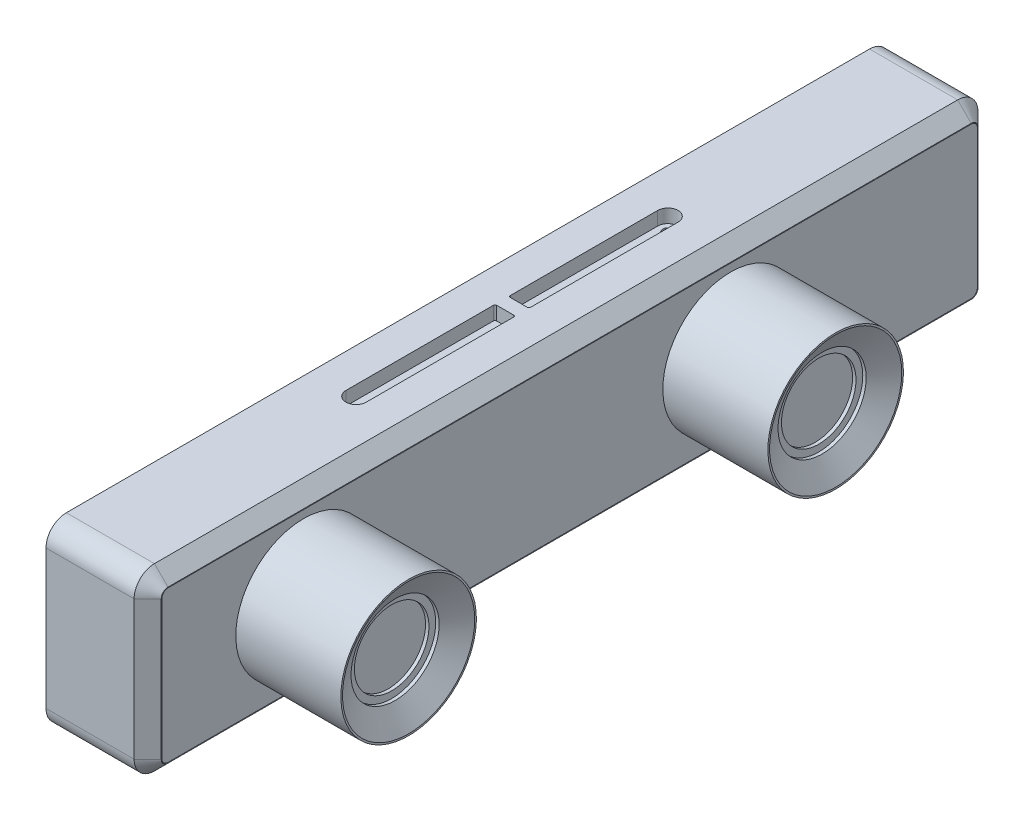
ISO-10303-21;
HEADER;
FILE_DESCRIPTION(('STEP AP214'),'2;1');
FILE_NAME('part.step','',(''),(''),'','','');
FILE_SCHEMA(('AUTOMOTIVE_DESIGN { 1 0 10303 214 1 1 1 1 }'));
ENDSEC;
DATA;
#1=APPLICATION_CONTEXT('core data for automotive mechanical design processes');
#2=APPLICATION_PROTOCOL_DEFINITION('international standard','automotive_design',2000,#1);
#3=PRODUCT_CONTEXT('',#1,'mechanical');
#4=PRODUCT('Part','Part','',(#3));
#5=PRODUCT_RELATED_PRODUCT_CATEGORY('part','',(#4));
#6=PRODUCT_DEFINITION_FORMATION('','',#4);
#7=PRODUCT_DEFINITION_CONTEXT('part definition',#1,'design');
#8=PRODUCT_DEFINITION('design','',#6,#7);
#9=PRODUCT_DEFINITION_SHAPE('','',#8);
#10=(LENGTH_UNIT() NAMED_UNIT(*) SI_UNIT(.MILLI.,.METRE.));
#11=(NAMED_UNIT(*) PLANE_ANGLE_UNIT() SI_UNIT($,.RADIAN.));
#12=(NAMED_UNIT(*) SI_UNIT($,.STERADIAN.) SOLID_ANGLE_UNIT());
#13=UNCERTAINTY_MEASURE_WITH_UNIT(LENGTH_MEASURE(1.E-05),#10,'distance_accuracy_value','');
#14=(GEOMETRIC_REPRESENTATION_CONTEXT(3) GLOBAL_UNCERTAINTY_ASSIGNED_CONTEXT((#13)) GLOBAL_UNIT_ASSIGNED_CONTEXT((#10,
#11,#12)) REPRESENTATION_CONTEXT('',''));
#15=CARTESIAN_POINT('',(0.,0.,0.));
#16=DIRECTION('',(0.,0.,1.));
#17=DIRECTION('',(1.,0.,0.));
#18=AXIS2_PLACEMENT_3D('',#15,#16,#17);
#19=CARTESIAN_POINT('',(21.,0.,39.25));
#20=DIRECTION('',(-1.,0.,0.));
#21=DIRECTION('',(0.,0.,1.));
#22=AXIS2_PLACEMENT_3D('',#19,#20,#21);
#23=PLANE('',#22);
#24=CARTESIAN_POINT('',(21.,0.,39.25));
#25=DIRECTION('',(-1.,0.,0.));
#26=DIRECTION('',(0.,0.,1.));
#27=AXIS2_PLACEMENT_3D('',#24,#25,#26);
#28=CIRCLE('',#27,5.5);
#29=CARTESIAN_POINT('',(21.,0.,44.75));
#30=VERTEX_POINT('',#29);
#31=EDGE_CURVE('E20',#30,#30,#28,.F.);
#32=ORIENTED_EDGE('',*,*,#31,.T.);
#33=EDGE_LOOP('',(#32));
#34=FACE_BOUND('',#33,.T.);
#35=ADVANCED_FACE('F17',(#34),#23,.F.);
#36=CARTESIAN_POINT('',(21.,0.,-23.75));
#37=DIRECTION('',(1.,0.,0.));
#38=DIRECTION('',(0.,0.,-1.));
#39=AXIS2_PLACEMENT_3D('',#36,#37,#38);
#40=PLANE('',#39);
#41=CARTESIAN_POINT('',(21.,0.,-23.75));
#42=DIRECTION('',(1.,0.,0.));
#43=DIRECTION('',(0.,0.,-1.));
#44=AXIS2_PLACEMENT_3D('',#41,#42,#43);
#45=CIRCLE('',#44,5.5);
#46=CARTESIAN_POINT('',(21.,0.,-29.25));
#47=VERTEX_POINT('',#46);
#48=EDGE_CURVE('E454',#47,#47,#45,.T.);
#49=ORIENTED_EDGE('',*,*,#48,.T.);
#50=EDGE_LOOP('',(#49));
#51=FACE_BOUND('',#50,.T.);
#52=ADVANCED_FACE('F465',(#51),#40,.T.);
#53=CARTESIAN_POINT('',(21.5,0.,39.25));
#54=DIRECTION('',(-1.,0.,0.));
#55=DIRECTION('',(0.,0.,1.));
#56=AXIS2_PLACEMENT_3D('',#53,#54,#55);
#57=CYLINDRICAL_SURFACE('',#56,5.5);
#58=CARTESIAN_POINT('',(21.5,0.,39.25));
#59=DIRECTION('',(-1.,0.,0.));
#60=DIRECTION('',(0.,0.,1.));
#61=AXIS2_PLACEMENT_3D('',#58,#59,#60);
#62=CIRCLE('',#61,5.5);
#63=CARTESIAN_POINT('',(21.5,0.,44.75));
#64=VERTEX_POINT('',#63);
#65=EDGE_CURVE('E452',#64,#64,#62,.F.);
#66=ORIENTED_EDGE('',*,*,#65,.T.);
#67=EDGE_LOOP('',(#66));
#68=FACE_BOUND('',#67,.T.);
#69=ORIENTED_EDGE('',*,*,#31,.F.);
#70=EDGE_LOOP('',(#69));
#71=FACE_BOUND('',#70,.T.);
#72=ADVANCED_FACE('F462',(#68,#71),#57,.F.);
#73=CARTESIAN_POINT('',(21.5,0.,-23.75));
#74=DIRECTION('',(1.,0.,0.));
#75=DIRECTION('',(0.,0.,-1.));
#76=AXIS2_PLACEMENT_3D('',#73,#74,#75);
#77=CYLINDRICAL_SURFACE('',#76,5.5);
#78=CARTESIAN_POINT('',(21.5,0.,-23.75));
#79=DIRECTION('',(1.,0.,0.));
#80=DIRECTION('',(0.,0.,-1.));
#81=AXIS2_PLACEMENT_3D('',#78,#79,#80);
#82=CIRCLE('',#81,5.5);
#83=CARTESIAN_POINT('',(21.5,0.,-29.25));
#84=VERTEX_POINT('',#83);
#85=EDGE_CURVE('E449',#84,#84,#82,.F.);
#86=ORIENTED_EDGE('',*,*,#85,.F.);
#87=EDGE_LOOP('',(#86));
#88=FACE_BOUND('',#87,.T.);
#89=ORIENTED_EDGE('',*,*,#48,.F.);
#90=EDGE_LOOP('',(#89));
#91=FACE_BOUND('',#90,.T.);
#92=ADVANCED_FACE('F464',(#88,#91),#77,.F.);
#93=CARTESIAN_POINT('',(21.5,0.,39.25));
#94=DIRECTION('',(-1.,0.,0.));
#95=DIRECTION('',(0.,0.,1.));
#96=AXIS2_PLACEMENT_3D('',#93,#94,#95);
#97=PLANE('',#96);
#98=ORIENTED_EDGE('',*,*,#65,.F.);
#99=EDGE_LOOP('',(#98));
#100=FACE_BOUND('',#99,.T.);
#101=CARTESIAN_POINT('',(21.5,0.,39.25));
#102=DIRECTION('',(-1.,0.,0.));
#103=DIRECTION('',(0.,0.,1.));
#104=AXIS2_PLACEMENT_3D('',#101,#102,#103);
#105=CIRCLE('',#104,6.5);
#106=CARTESIAN_POINT('',(21.5,0.,45.75));
#107=VERTEX_POINT('',#106);
#108=EDGE_CURVE('E446',#107,#107,#105,.F.);
#109=ORIENTED_EDGE('',*,*,#108,.T.);
#110=EDGE_LOOP('',(#109));
#111=FACE_BOUND('',#110,.T.);
#112=ADVANCED_FACE('F473',(#100,#111),#97,.F.);
#113=CARTESIAN_POINT('',(21.5,0.,-23.75));
#114=DIRECTION('',(1.,0.,0.));
#115=DIRECTION('',(0.,0.,-1.));
#116=AXIS2_PLACEMENT_3D('',#113,#114,#115);
#117=PLANE('',#116);
#118=ORIENTED_EDGE('',*,*,#85,.T.);
#119=EDGE_LOOP('',(#118));
#120=FACE_BOUND('',#119,.T.);
#121=CARTESIAN_POINT('',(21.5,0.,-23.75));
#122=DIRECTION('',(1.,0.,0.));
#123=DIRECTION('',(0.,0.,-1.));
#124=AXIS2_PLACEMENT_3D('',#121,#122,#123);
#125=CIRCLE('',#124,6.5);
#126=CARTESIAN_POINT('',(21.5,0.,-30.25));
#127=VERTEX_POINT('',#126);
#128=EDGE_CURVE('E300',#127,#127,#125,.T.);
#129=ORIENTED_EDGE('',*,*,#128,.T.);
#130=EDGE_LOOP('',(#129));
#131=FACE_BOUND('',#130,.T.);
#132=ADVANCED_FACE('F1062',(#120,#131),#117,.T.);
#133=CARTESIAN_POINT('',(22.,0.,39.25));
#134=DIRECTION('',(-1.,0.,0.));
#135=DIRECTION('',(0.,0.,1.));
#136=AXIS2_PLACEMENT_3D('',#133,#134,#135);
#137=CYLINDRICAL_SURFACE('',#136,6.5);
#138=CARTESIAN_POINT('',(22.0000000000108,0.,39.25));
#139=DIRECTION('',(1.,0.,0.));
#140=DIRECTION('',(0.,0.,1.));
#141=AXIS2_PLACEMENT_3D('',#138,#139,#140);
#142=CIRCLE('',#141,6.49999999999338);
#143=CARTESIAN_POINT('',(22.0000000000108,0.,45.7499999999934));
#144=VERTEX_POINT('',#143);
#145=EDGE_CURVE('E295',#144,#144,#142,.T.);
#146=ORIENTED_EDGE('',*,*,#145,.T.);
#147=EDGE_LOOP('',(#146));
#148=FACE_BOUND('',#147,.T.);
#149=ORIENTED_EDGE('',*,*,#108,.F.);
#150=EDGE_LOOP('',(#149));
#151=FACE_BOUND('',#150,.T.);
#152=ADVANCED_FACE('F1058',(#148,#151),#137,.F.);
#153=CARTESIAN_POINT('',(22.,0.,-23.75));
#154=DIRECTION('',(1.,0.,0.));
#155=DIRECTION('',(0.,0.,-1.));
#156=AXIS2_PLACEMENT_3D('',#153,#154,#155);
#157=CYLINDRICAL_SURFACE('',#156,6.5);
#158=CARTESIAN_POINT('',(22.0000000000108,0.,-23.75));
#159=DIRECTION('',(1.,0.,0.));
#160=DIRECTION('',(0.,0.,-1.));
#161=AXIS2_PLACEMENT_3D('',#158,#159,#160);
#162=CIRCLE('',#161,6.49999999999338);
#163=CARTESIAN_POINT('',(22.0000000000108,0.,-30.2499999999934));
#164=VERTEX_POINT('',#163);
#165=EDGE_CURVE('E291',#164,#164,#162,.T.);
#166=ORIENTED_EDGE('',*,*,#165,.T.);
#167=EDGE_LOOP('',(#166));
#168=FACE_BOUND('',#167,.T.);
#169=ORIENTED_EDGE('',*,*,#128,.F.);
#170=EDGE_LOOP('',(#169));
#171=FACE_BOUND('',#170,.T.);
#172=ADVANCED_FACE('F1054',(#168,#171),#157,.F.);
#173=CARTESIAN_POINT('',(24.,0.,39.25));
#174=DIRECTION('',(1.,0.,0.));
#175=DIRECTION('',(0.,0.,-1.));
#176=AXIS2_PLACEMENT_3D('',#173,#174,#175);
#177=CONICAL_SURFACE('',#176,9.74999999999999,1.01914134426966);
#178=ORIENTED_EDGE('',*,*,#145,.F.);
#179=EDGE_LOOP('',(#178));
#180=FACE_BOUND('',#179,.T.);
#181=CARTESIAN_POINT('',(24.,0.,39.25));
#182=DIRECTION('',(1.,0.,0.));
#183=DIRECTION('',(0.,0.,-1.));
#184=AXIS2_PLACEMENT_3D('',#181,#182,#183);
#185=CIRCLE('',#184,9.74999999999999);
#186=CARTESIAN_POINT('',(24.,0.,29.5));
#187=VERTEX_POINT('',#186);
#188=EDGE_CURVE('E294',#187,#187,#185,.F.);
#189=ORIENTED_EDGE('',*,*,#188,.F.);
#190=EDGE_LOOP('',(#189));
#191=FACE_BOUND('',#190,.T.);
#192=ADVANCED_FACE('F1050',(#180,#191),#177,.F.);
#193=CARTESIAN_POINT('',(24.,0.,-23.75));
#194=DIRECTION('',(1.,0.,0.));
#195=DIRECTION('',(0.,0.,-1.));
#196=AXIS2_PLACEMENT_3D('',#193,#194,#195);
#197=CONICAL_SURFACE('',#196,9.75,1.01914134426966);
#198=ORIENTED_EDGE('',*,*,#165,.F.);
#199=EDGE_LOOP('',(#198));
#200=FACE_BOUND('',#199,.T.);
#201=CARTESIAN_POINT('',(24.,0.,-23.75));
#202=DIRECTION('',(1.,0.,0.));
#203=DIRECTION('',(0.,0.,-1.));
#204=AXIS2_PLACEMENT_3D('',#201,#202,#203);
#205=CIRCLE('',#204,9.75);
#206=CARTESIAN_POINT('',(24.,0.,-33.5));
#207=VERTEX_POINT('',#206);
#208=EDGE_CURVE('E439',#207,#207,#205,.F.);
#209=ORIENTED_EDGE('',*,*,#208,.F.);
#210=EDGE_LOOP('',(#209));
#211=FACE_BOUND('',#210,.T.);
#212=ADVANCED_FACE('F1046',(#200,#211),#197,.F.);
#213=CARTESIAN_POINT('',(24.,0.,39.25));
#214=DIRECTION('',(1.,0.,0.));
#215=DIRECTION('',(0.,0.,-1.));
#216=AXIS2_PLACEMENT_3D('',#213,#214,#215);
#217=PLANE('',#216);
#218=ORIENTED_EDGE('',*,*,#188,.T.);
#219=EDGE_LOOP('',(#218));
#220=FACE_BOUND('',#219,.T.);
#221=CARTESIAN_POINT('',(24.,0.,39.25));
#222=DIRECTION('',(1.,0.,0.));
#223=DIRECTION('',(0.,1.,0.));
#224=AXIS2_PLACEMENT_3D('',#221,#222,#223);
#225=CIRCLE('',#224,10.);
#226=CARTESIAN_POINT('',(24.,10.,39.25));
#227=VERTEX_POINT('',#226);
#228=EDGE_CURVE('E436',#227,#227,#225,.F.);
#229=ORIENTED_EDGE('',*,*,#228,.F.);
#230=EDGE_LOOP('',(#229));
#231=FACE_BOUND('',#230,.T.);
#232=ADVANCED_FACE('F1042',(#220,#231),#217,.T.);
#233=CARTESIAN_POINT('',(24.,0.,-23.75));
#234=DIRECTION('',(1.,0.,0.));
#235=DIRECTION('',(0.,0.,-1.));
#236=AXIS2_PLACEMENT_3D('',#233,#234,#235);
#237=PLANE('',#236);
#238=ORIENTED_EDGE('',*,*,#208,.T.);
#239=EDGE_LOOP('',(#238));
#240=FACE_BOUND('',#239,.T.);
#241=CARTESIAN_POINT('',(24.,0.,-23.75));
#242=DIRECTION('',(1.,0.,0.));
#243=DIRECTION('',(0.,1.,0.));
#244=AXIS2_PLACEMENT_3D('',#241,#242,#243);
#245=CIRCLE('',#244,10.);
#246=CARTESIAN_POINT('',(24.,10.,-23.75));
#247=VERTEX_POINT('',#246);
#248=EDGE_CURVE('E241',#247,#247,#245,.F.);
#249=ORIENTED_EDGE('',*,*,#248,.F.);
#250=EDGE_LOOP('',(#249));
#251=FACE_BOUND('',#250,.T.);
#252=ADVANCED_FACE('F1038',(#240,#251),#237,.T.);
#253=CARTESIAN_POINT('',(8.5,0.,39.25));
#254=DIRECTION('',(1.,0.,0.));
#255=DIRECTION('',(0.,1.,0.));
#256=AXIS2_PLACEMENT_3D('',#253,#254,#255);
#257=CYLINDRICAL_SURFACE('',#256,10.);
#258=CARTESIAN_POINT('',(8.5,0.,39.25));
#259=DIRECTION('',(1.,0.,0.));
#260=DIRECTION('',(0.,1.,0.));
#261=AXIS2_PLACEMENT_3D('',#258,#259,#260);
#262=CIRCLE('',#261,10.);
#263=CARTESIAN_POINT('',(8.5,10.,39.25));
#264=VERTEX_POINT('',#263);
#265=EDGE_CURVE('E240',#264,#264,#262,.F.);
#266=ORIENTED_EDGE('',*,*,#265,.F.);
#267=EDGE_LOOP('',(#266));
#268=FACE_BOUND('',#267,.T.);
#269=ORIENTED_EDGE('',*,*,#228,.T.);
#270=EDGE_LOOP('',(#269));
#271=FACE_BOUND('',#270,.T.);
#272=ADVANCED_FACE('F1034',(#268,#271),#257,.T.);
#273=CARTESIAN_POINT('',(8.50000000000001,0.,-23.75));
#274=DIRECTION('',(1.,0.,0.));
#275=DIRECTION('',(0.,1.,0.));
#276=AXIS2_PLACEMENT_3D('',#273,#274,#275);
#277=CYLINDRICAL_SURFACE('',#276,10.);
#278=CARTESIAN_POINT('',(8.50000000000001,0.,-23.75));
#279=DIRECTION('',(1.,0.,0.));
#280=DIRECTION('',(0.,1.,0.));
#281=AXIS2_PLACEMENT_3D('',#278,#279,#280);
#282=CIRCLE('',#281,10.);
#283=CARTESIAN_POINT('',(8.50000000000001,10.,-23.75));
#284=VERTEX_POINT('',#283);
#285=EDGE_CURVE('E286',#284,#284,#282,.F.);
#286=ORIENTED_EDGE('',*,*,#285,.F.);
#287=EDGE_LOOP('',(#286));
#288=FACE_BOUND('',#287,.T.);
#289=ORIENTED_EDGE('',*,*,#248,.T.);
#290=EDGE_LOOP('',(#289));
#291=FACE_BOUND('',#290,.T.);
#292=ADVANCED_FACE('F1030',(#288,#291),#277,.T.);
#293=CARTESIAN_POINT('',(8.5,0.,0.));
#294=DIRECTION('',(1.,0.,0.));
#295=DIRECTION('',(0.,0.,-1.));
#296=AXIS2_PLACEMENT_3D('',#293,#294,#295);
#297=PLANE('',#296);
#298=ORIENTED_EDGE('',*,*,#285,.T.);
#299=EDGE_LOOP('',(#298));
#300=FACE_BOUND('',#299,.T.);
#301=ORIENTED_EDGE('',*,*,#265,.T.);
#302=EDGE_LOOP('',(#301));
#303=FACE_BOUND('',#302,.T.);
#304=DIRECTION('',(0.,0.,1.));
#305=VECTOR('',#304,1.);
#306=CARTESIAN_POINT('',(8.5,11.15,59.25));
#307=LINE('',#306,#305);
#308=CARTESIAN_POINT('',(8.5,11.15,59.25));
#309=VERTEX_POINT('',#308);
#310=CARTESIAN_POINT('',(8.50000000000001,11.15,-59.25));
#311=VERTEX_POINT('',#310);
#312=EDGE_CURVE('E280',#309,#311,#307,.F.);
#313=ORIENTED_EDGE('',*,*,#312,.F.);
#314=CARTESIAN_POINT('',(8.5,10.25,59.25));
#315=DIRECTION('',(-1.,0.,0.));
#316=DIRECTION('',(0.,0.,1.));
#317=AXIS2_PLACEMENT_3D('',#314,#315,#316);
#318=CIRCLE('',#317,0.900000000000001);
#319=CARTESIAN_POINT('',(8.5,10.25,60.15));
#320=VERTEX_POINT('',#319);
#321=EDGE_CURVE('E283',#320,#309,#318,.T.);
#322=ORIENTED_EDGE('',*,*,#321,.F.);
#323=DIRECTION('',(0.,-1.,0.));
#324=VECTOR('',#323,1.);
#325=CARTESIAN_POINT('',(8.5,-10.25,60.15));
#326=LINE('',#325,#324);
#327=CARTESIAN_POINT('',(8.5,-10.25,60.15));
#328=VERTEX_POINT('',#327);
#329=EDGE_CURVE('E238',#328,#320,#326,.F.);
#330=ORIENTED_EDGE('',*,*,#329,.F.);
#331=CARTESIAN_POINT('',(8.5,-10.25,59.25));
#332=DIRECTION('',(-1.,0.,0.));
#333=DIRECTION('',(0.,0.,1.));
#334=AXIS2_PLACEMENT_3D('',#331,#332,#333);
#335=CIRCLE('',#334,0.9);
#336=CARTESIAN_POINT('',(8.50000000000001,-11.15,59.25));
#337=VERTEX_POINT('',#336);
#338=EDGE_CURVE('E230',#328,#337,#335,.F.);
#339=ORIENTED_EDGE('',*,*,#338,.T.);
#340=DIRECTION('',(0.,0.,-1.));
#341=VECTOR('',#340,1.);
#342=CARTESIAN_POINT('',(8.50000000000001,-11.15,-59.25));
#343=LINE('',#342,#341);
#344=CARTESIAN_POINT('',(8.50000000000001,-11.15,-59.25));
#345=VERTEX_POINT('',#344);
#346=EDGE_CURVE('E235',#345,#337,#343,.F.);
#347=ORIENTED_EDGE('',*,*,#346,.F.);
#348=CARTESIAN_POINT('',(8.50000000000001,-10.25,-59.25));
#349=DIRECTION('',(-1.,0.,0.));
#350=DIRECTION('',(0.,0.,1.));
#351=AXIS2_PLACEMENT_3D('',#348,#349,#350);
#352=CIRCLE('',#351,0.900000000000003);
#353=CARTESIAN_POINT('',(8.50000000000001,-10.25,-60.15));
#354=VERTEX_POINT('',#353);
#355=EDGE_CURVE('E268',#354,#345,#352,.T.);
#356=ORIENTED_EDGE('',*,*,#355,.F.);
#357=DIRECTION('',(0.,1.,0.));
#358=VECTOR('',#357,1.);
#359=CARTESIAN_POINT('',(8.50000000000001,10.25,-60.15));
#360=LINE('',#359,#358);
#361=CARTESIAN_POINT('',(8.50000000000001,10.25,-60.15));
#362=VERTEX_POINT('',#361);
#363=EDGE_CURVE('E272',#362,#354,#360,.F.);
#364=ORIENTED_EDGE('',*,*,#363,.F.);
#365=CARTESIAN_POINT('',(8.50000000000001,10.25,-59.25));
#366=DIRECTION('',(-1.,0.,0.));
#367=DIRECTION('',(0.,0.,1.));
#368=AXIS2_PLACEMENT_3D('',#365,#366,#367);
#369=CIRCLE('',#368,0.899999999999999);
#370=EDGE_CURVE('E276',#311,#362,#369,.T.);
#371=ORIENTED_EDGE('',*,*,#370,.F.);
#372=EDGE_LOOP('',(#313,#322,#330,#339,#347,#356,#364,#371));
#373=FACE_BOUND('',#372,.T.);
#374=ADVANCED_FACE('F234',(#300,#303,#373),#297,.T.);
#375=CARTESIAN_POINT('',(8.5,-10.25,60.15));
#376=DIRECTION('',(0.,0.,1.));
#377=DIRECTION('',(0.,-1.,0.));
#378=AXIS2_PLACEMENT_3D('',#375,#376,#377);
#379=PLANE('',#378);
#380=DIRECTION('',(0.,1.,0.));
#381=VECTOR('',#380,1.);
#382=CARTESIAN_POINT('',(8.24999999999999,0.,60.15));
#383=LINE('',#382,#381);
#384=CARTESIAN_POINT('',(8.25,-10.25,60.15));
#385=VERTEX_POINT('',#384);
#386=CARTESIAN_POINT('',(8.25,10.25,60.15));
#387=VERTEX_POINT('',#386);
#388=EDGE_CURVE('E256',#385,#387,#383,.T.);
#389=ORIENTED_EDGE('',*,*,#388,.F.);
#390=DIRECTION('',(-1.,0.,0.));
#391=VECTOR('',#390,1.);
#392=CARTESIAN_POINT('',(8.5,-10.25,60.15));
#393=LINE('',#392,#391);
#394=EDGE_CURVE('E257',#328,#385,#393,.T.);
#395=ORIENTED_EDGE('',*,*,#394,.F.);
#396=ORIENTED_EDGE('',*,*,#329,.T.);
#397=DIRECTION('',(-1.,0.,0.));
#398=VECTOR('',#397,1.);
#399=CARTESIAN_POINT('',(8.5,10.25,60.15));
#400=LINE('',#399,#398);
#401=EDGE_CURVE('E281',#387,#320,#400,.F.);
#402=ORIENTED_EDGE('',*,*,#401,.F.);
#403=EDGE_LOOP('',(#389,#395,#396,#402));
#404=FACE_BOUND('',#403,.T.);
#405=ADVANCED_FACE('F1023',(#404),#379,.T.);
#406=CARTESIAN_POINT('',(8.5,10.25,59.25));
#407=DIRECTION('',(-1.,0.,0.));
#408=DIRECTION('',(0.,0.,1.));
#409=AXIS2_PLACEMENT_3D('',#406,#407,#408);
#410=CYLINDRICAL_SURFACE('',#409,0.900000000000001);
#411=CARTESIAN_POINT('',(8.25,10.25,59.25));
#412=DIRECTION('',(-1.,0.,0.));
#413=DIRECTION('',(0.,0.,1.));
#414=AXIS2_PLACEMENT_3D('',#411,#412,#413);
#415=CIRCLE('',#414,0.900000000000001);
#416=CARTESIAN_POINT('',(8.25,11.15,59.25));
#417=VERTEX_POINT('',#416);
#418=EDGE_CURVE('E260',#387,#417,#415,.T.);
#419=ORIENTED_EDGE('',*,*,#418,.F.);
#420=ORIENTED_EDGE('',*,*,#401,.T.);
#421=ORIENTED_EDGE('',*,*,#321,.T.);
#422=DIRECTION('',(1.,0.,0.));
#423=VECTOR('',#422,1.);
#424=CARTESIAN_POINT('',(8.5,11.15,59.25));
#425=LINE('',#424,#423);
#426=EDGE_CURVE('E277',#417,#309,#425,.T.);
#427=ORIENTED_EDGE('',*,*,#426,.F.);
#428=EDGE_LOOP('',(#419,#420,#421,#427));
#429=FACE_BOUND('',#428,.T.);
#430=ADVANCED_FACE('F1019',(#429),#410,.T.);
#431=CARTESIAN_POINT('',(8.5,11.15,59.25));
#432=DIRECTION('',(0.,1.,0.));
#433=DIRECTION('',(0.,0.,1.));
#434=AXIS2_PLACEMENT_3D('',#431,#432,#433);
#435=PLANE('',#434);
#436=DIRECTION('',(0.,0.,-1.));
#437=VECTOR('',#436,1.);
#438=CARTESIAN_POINT('',(8.25,11.15,0.));
#439=LINE('',#438,#437);
#440=CARTESIAN_POINT('',(8.25000000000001,11.15,-59.25));
#441=VERTEX_POINT('',#440);
#442=EDGE_CURVE('E422',#417,#441,#439,.T.);
#443=ORIENTED_EDGE('',*,*,#442,.F.);
#444=ORIENTED_EDGE('',*,*,#426,.T.);
#445=ORIENTED_EDGE('',*,*,#312,.T.);
#446=DIRECTION('',(-1.,0.,0.));
#447=VECTOR('',#446,1.);
#448=CARTESIAN_POINT('',(8.50000000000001,11.15,-59.25));
#449=LINE('',#448,#447);
#450=EDGE_CURVE('E273',#441,#311,#449,.F.);
#451=ORIENTED_EDGE('',*,*,#450,.F.);
#452=EDGE_LOOP('',(#443,#444,#445,#451));
#453=FACE_BOUND('',#452,.T.);
#454=ADVANCED_FACE('F1015',(#453),#435,.T.);
#455=CARTESIAN_POINT('',(8.50000000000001,10.25,-59.25));
#456=DIRECTION('',(-1.,0.,0.));
#457=DIRECTION('',(0.,0.,1.));
#458=AXIS2_PLACEMENT_3D('',#455,#456,#457);
#459=CYLINDRICAL_SURFACE('',#458,0.899999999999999);
#460=CARTESIAN_POINT('',(8.25000000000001,10.25,-59.25));
#461=DIRECTION('',(-1.,0.,0.));
#462=DIRECTION('',(0.,0.,1.));
#463=AXIS2_PLACEMENT_3D('',#460,#461,#462);
#464=CIRCLE('',#463,0.899999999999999);
#465=CARTESIAN_POINT('',(8.25000000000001,10.25,-60.15));
#466=VERTEX_POINT('',#465);
#467=EDGE_CURVE('E419',#441,#466,#464,.T.);
#468=ORIENTED_EDGE('',*,*,#467,.F.);
#469=ORIENTED_EDGE('',*,*,#450,.T.);
#470=ORIENTED_EDGE('',*,*,#370,.T.);
#471=DIRECTION('',(1.,0.,0.));
#472=VECTOR('',#471,1.);
#473=CARTESIAN_POINT('',(8.50000000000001,10.25,-60.15));
#474=LINE('',#473,#472);
#475=EDGE_CURVE('E269',#466,#362,#474,.T.);
#476=ORIENTED_EDGE('',*,*,#475,.F.);
#477=EDGE_LOOP('',(#468,#469,#470,#476));
#478=FACE_BOUND('',#477,.T.);
#479=ADVANCED_FACE('F1011',(#478),#459,.T.);
#480=CARTESIAN_POINT('',(8.50000000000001,10.25,-60.15));
#481=DIRECTION('',(0.,0.,-1.));
#482=DIRECTION('',(0.,1.,0.));
#483=AXIS2_PLACEMENT_3D('',#480,#481,#482);
#484=PLANE('',#483);
#485=DIRECTION('',(0.,1.,0.));
#486=VECTOR('',#485,1.);
#487=CARTESIAN_POINT('',(8.25000000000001,0.,-60.15));
#488=LINE('',#487,#486);
#489=CARTESIAN_POINT('',(8.25000000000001,-10.25,-60.15));
#490=VERTEX_POINT('',#489);
#491=EDGE_CURVE('E418',#466,#490,#488,.F.);
#492=ORIENTED_EDGE('',*,*,#491,.F.);
#493=ORIENTED_EDGE('',*,*,#475,.T.);
#494=ORIENTED_EDGE('',*,*,#363,.T.);
#495=DIRECTION('',(-1.,0.,0.));
#496=VECTOR('',#495,1.);
#497=CARTESIAN_POINT('',(8.50000000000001,-10.25,-60.15));
#498=LINE('',#497,#496);
#499=EDGE_CURVE('E250',#490,#354,#498,.F.);
#500=ORIENTED_EDGE('',*,*,#499,.F.);
#501=EDGE_LOOP('',(#492,#493,#494,#500));
#502=FACE_BOUND('',#501,.T.);
#503=ADVANCED_FACE('F1007',(#502),#484,.T.);
#504=CARTESIAN_POINT('',(8.50000000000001,-10.25,-59.25));
#505=DIRECTION('',(-1.,0.,0.));
#506=DIRECTION('',(0.,0.,1.));
#507=AXIS2_PLACEMENT_3D('',#504,#505,#506);
#508=CYLINDRICAL_SURFACE('',#507,0.900000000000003);
#509=CARTESIAN_POINT('',(8.25000000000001,-10.25,-59.25));
#510=DIRECTION('',(-1.,0.,0.));
#511=DIRECTION('',(0.,0.,1.));
#512=AXIS2_PLACEMENT_3D('',#509,#510,#511);
#513=CIRCLE('',#512,0.900000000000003);
#514=CARTESIAN_POINT('',(8.25000000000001,-11.15,-59.25));
#515=VERTEX_POINT('',#514);
#516=EDGE_CURVE('E415',#490,#515,#513,.T.);
#517=ORIENTED_EDGE('',*,*,#516,.F.);
#518=ORIENTED_EDGE('',*,*,#499,.T.);
#519=ORIENTED_EDGE('',*,*,#355,.T.);
#520=DIRECTION('',(1.,0.,0.));
#521=VECTOR('',#520,1.);
#522=CARTESIAN_POINT('',(8.50000000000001,-11.15,-59.25));
#523=LINE('',#522,#521);
#524=EDGE_CURVE('E249',#515,#345,#523,.T.);
#525=ORIENTED_EDGE('',*,*,#524,.F.);
#526=EDGE_LOOP('',(#517,#518,#519,#525));
#527=FACE_BOUND('',#526,.T.);
#528=ADVANCED_FACE('F1004',(#527),#508,.T.);
#529=CARTESIAN_POINT('',(8.50000000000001,-11.15,-59.25));
#530=DIRECTION('',(0.,-1.,0.));
#531=DIRECTION('',(0.,0.,-1.));
#532=AXIS2_PLACEMENT_3D('',#529,#530,#531);
#533=PLANE('',#532);
#534=DIRECTION('',(0.,0.,-1.));
#535=VECTOR('',#534,1.);
#536=CARTESIAN_POINT('',(8.25,-11.15,0.));
#537=LINE('',#536,#535);
#538=CARTESIAN_POINT('',(8.25,-11.15,59.25));
#539=VERTEX_POINT('',#538);
#540=EDGE_CURVE('E414',#515,#539,#537,.F.);
#541=ORIENTED_EDGE('',*,*,#540,.F.);
#542=ORIENTED_EDGE('',*,*,#524,.T.);
#543=ORIENTED_EDGE('',*,*,#346,.T.);
#544=DIRECTION('',(-1.,0.,0.));
#545=VECTOR('',#544,1.);
#546=CARTESIAN_POINT('',(8.5,-11.15,59.25));
#547=LINE('',#546,#545);
#548=EDGE_CURVE('E247',#539,#337,#547,.F.);
#549=ORIENTED_EDGE('',*,*,#548,.F.);
#550=EDGE_LOOP('',(#541,#542,#543,#549));
#551=FACE_BOUND('',#550,.T.);
#552=ADVANCED_FACE('F246',(#551),#533,.T.);
#553=CARTESIAN_POINT('',(8.5,-10.25,59.25));
#554=DIRECTION('',(-1.,0.,0.));
#555=DIRECTION('',(0.,0.,1.));
#556=AXIS2_PLACEMENT_3D('',#553,#554,#555);
#557=CYLINDRICAL_SURFACE('',#556,0.9);
#558=CARTESIAN_POINT('',(8.25,-10.25,59.25));
#559=DIRECTION('',(-1.,0.,0.));
#560=DIRECTION('',(0.,0.,1.));
#561=AXIS2_PLACEMENT_3D('',#558,#559,#560);
#562=CIRCLE('',#561,0.9);
#563=EDGE_CURVE('E254',#539,#385,#562,.T.);
#564=ORIENTED_EDGE('',*,*,#563,.F.);
#565=ORIENTED_EDGE('',*,*,#548,.T.);
#566=ORIENTED_EDGE('',*,*,#338,.F.);
#567=ORIENTED_EDGE('',*,*,#394,.T.);
#568=EDGE_LOOP('',(#564,#565,#566,#567));
#569=FACE_BOUND('',#568,.T.);
#570=ADVANCED_FACE('F252',(#569),#557,.T.);
#571=CARTESIAN_POINT('',(0.,-10.25,-23.));
#572=DIRECTION('',(0.,1.,0.));
#573=DIRECTION('',(0.,0.,1.));
#574=AXIS2_PLACEMENT_3D('',#571,#572,#573);
#575=PLANE('',#574);
#576=CARTESIAN_POINT('',(0.,-10.25,-23.));
#577=DIRECTION('',(0.,1.,0.));
#578=DIRECTION('',(0.,0.,1.));
#579=AXIS2_PLACEMENT_3D('',#576,#577,#578);
#580=CIRCLE('',#579,0.75);
#581=CARTESIAN_POINT('',(0.,-10.25,-22.25));
#582=VERTEX_POINT('',#581);
#583=EDGE_CURVE('E402',#582,#582,#580,.F.);
#584=ORIENTED_EDGE('',*,*,#583,.T.);
#585=EDGE_LOOP('',(#584));
#586=FACE_BOUND('',#585,.T.);
#587=ADVANCED_FACE('F995',(#586),#575,.F.);
#588=CARTESIAN_POINT('',(0.,-10.25,23.));
#589=DIRECTION('',(0.,1.,0.));
#590=DIRECTION('',(0.,0.,1.));
#591=AXIS2_PLACEMENT_3D('',#588,#589,#590);
#592=PLANE('',#591);
#593=CARTESIAN_POINT('',(0.,-10.25,23.));
#594=DIRECTION('',(0.,1.,0.));
#595=DIRECTION('',(0.,0.,1.));
#596=AXIS2_PLACEMENT_3D('',#593,#594,#595);
#597=CIRCLE('',#596,0.75);
#598=CARTESIAN_POINT('',(0.,-10.25,23.75));
#599=VERTEX_POINT('',#598);
#600=EDGE_CURVE('E399',#599,#599,#597,.F.);
#601=ORIENTED_EDGE('',*,*,#600,.T.);
#602=EDGE_LOOP('',(#601));
#603=FACE_BOUND('',#602,.T.);
#604=ADVANCED_FACE('F991',(#603),#592,.F.);
#605=CARTESIAN_POINT('',(8.25,0.,0.));
#606=DIRECTION('',(1.,0.,0.));
#607=DIRECTION('',(0.,0.,-1.));
#608=AXIS2_PLACEMENT_3D('',#605,#606,#607);
#609=PLANE('',#608);
#610=ORIENTED_EDGE('',*,*,#540,.T.);
#611=ORIENTED_EDGE('',*,*,#563,.T.);
#612=ORIENTED_EDGE('',*,*,#388,.T.);
#613=ORIENTED_EDGE('',*,*,#418,.T.);
#614=ORIENTED_EDGE('',*,*,#442,.T.);
#615=ORIENTED_EDGE('',*,*,#467,.T.);
#616=ORIENTED_EDGE('',*,*,#491,.T.);
#617=ORIENTED_EDGE('',*,*,#516,.T.);
#618=EDGE_LOOP('',(#610,#611,#612,#613,#614,#615,#616,#617));
#619=FACE_BOUND('',#618,.T.);
#620=CARTESIAN_POINT('',(8.25000000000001,-10.25,-59.25));
#621=DIRECTION('',(-1.,0.,0.));
#622=DIRECTION('',(0.,0.,1.));
#623=AXIS2_PLACEMENT_3D('',#620,#621,#622);
#624=CIRCLE('',#623,0.999999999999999);
#625=CARTESIAN_POINT('',(8.25000000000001,-11.25,-59.25));
#626=VERTEX_POINT('',#625);
#627=CARTESIAN_POINT('',(8.25000000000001,-10.25,-60.25));
#628=VERTEX_POINT('',#627);
#629=EDGE_CURVE('E406',#626,#628,#624,.F.);
#630=ORIENTED_EDGE('',*,*,#629,.T.);
#631=DIRECTION('',(0.,1.,0.));
#632=VECTOR('',#631,1.);
#633=CARTESIAN_POINT('',(8.25000000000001,10.25,-60.25));
#634=LINE('',#633,#632);
#635=CARTESIAN_POINT('',(8.25000000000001,10.25,-60.25));
#636=VERTEX_POINT('',#635);
#637=EDGE_CURVE('E412',#628,#636,#634,.T.);
#638=ORIENTED_EDGE('',*,*,#637,.T.);
#639=CARTESIAN_POINT('',(8.25000000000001,10.25,-59.25));
#640=DIRECTION('',(-1.,0.,0.));
#641=DIRECTION('',(0.,0.,1.));
#642=AXIS2_PLACEMENT_3D('',#639,#640,#641);
#643=CIRCLE('',#642,0.999999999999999);
#644=CARTESIAN_POINT('',(8.25000000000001,11.25,-59.25));
#645=VERTEX_POINT('',#644);
#646=EDGE_CURVE('E410',#636,#645,#643,.F.);
#647=ORIENTED_EDGE('',*,*,#646,.T.);
#648=DIRECTION('',(0.,0.,1.));
#649=VECTOR('',#648,1.);
#650=CARTESIAN_POINT('',(8.25000000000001,11.25,59.25));
#651=LINE('',#650,#649);
#652=CARTESIAN_POINT('',(8.25000000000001,11.25,59.25));
#653=VERTEX_POINT('',#652);
#654=EDGE_CURVE('E678',#645,#653,#651,.T.);
#655=ORIENTED_EDGE('',*,*,#654,.T.);
#656=CARTESIAN_POINT('',(8.25,10.25,59.25));
#657=DIRECTION('',(-1.,0.,0.));
#658=DIRECTION('',(0.,0.,1.));
#659=AXIS2_PLACEMENT_3D('',#656,#657,#658);
#660=CIRCLE('',#659,0.999999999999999);
#661=CARTESIAN_POINT('',(8.25,10.25,60.25));
#662=VERTEX_POINT('',#661);
#663=EDGE_CURVE('E392',#653,#662,#660,.F.);
#664=ORIENTED_EDGE('',*,*,#663,.T.);
#665=DIRECTION('',(0.,-1.,0.));
#666=VECTOR('',#665,1.);
#667=CARTESIAN_POINT('',(8.25,-10.25,60.25));
#668=LINE('',#667,#666);
#669=CARTESIAN_POINT('',(8.25,-10.25,60.25));
#670=VERTEX_POINT('',#669);
#671=EDGE_CURVE('E689',#662,#670,#668,.T.);
#672=ORIENTED_EDGE('',*,*,#671,.T.);
#673=CARTESIAN_POINT('',(8.25,-10.25,59.25));
#674=DIRECTION('',(-1.,0.,0.));
#675=DIRECTION('',(0.,0.,1.));
#676=AXIS2_PLACEMENT_3D('',#673,#674,#675);
#677=CIRCLE('',#676,0.999999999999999);
#678=CARTESIAN_POINT('',(8.25,-11.25,59.25));
#679=VERTEX_POINT('',#678);
#680=EDGE_CURVE('E396',#670,#679,#677,.F.);
#681=ORIENTED_EDGE('',*,*,#680,.T.);
#682=DIRECTION('',(0.,0.,-1.));
#683=VECTOR('',#682,1.);
#684=CARTESIAN_POINT('',(8.25,-11.25,-59.25));
#685=LINE('',#684,#683);
#686=EDGE_CURVE('E699',#679,#626,#685,.T.);
#687=ORIENTED_EDGE('',*,*,#686,.T.);
#688=EDGE_LOOP('',(#630,#638,#647,#655,#664,#672,#681,#687));
#689=FACE_BOUND('',#688,.T.);
#690=ADVANCED_FACE('F718',(#619,#689),#609,.T.);
#691=CARTESIAN_POINT('',(0.,10.25,23.));
#692=DIRECTION('',(0.,1.,0.));
#693=DIRECTION('',(0.,0.,1.));
#694=AXIS2_PLACEMENT_3D('',#691,#692,#693);
#695=PLANE('',#694);
#696=CARTESIAN_POINT('',(0.,10.25,23.));
#697=DIRECTION('',(0.,-1.,0.));
#698=DIRECTION('',(0.,0.,-1.));
#699=AXIS2_PLACEMENT_3D('',#696,#697,#698);
#700=CIRCLE('',#699,0.75);
#701=CARTESIAN_POINT('',(0.,10.25,22.25));
#702=VERTEX_POINT('',#701);
#703=EDGE_CURVE('E388',#702,#702,#700,.F.);
#704=ORIENTED_EDGE('',*,*,#703,.T.);
#705=EDGE_LOOP('',(#704));
#706=FACE_BOUND('',#705,.T.);
#707=ADVANCED_FACE('F984',(#706),#695,.T.);
#708=CARTESIAN_POINT('',(0.,10.25,-23.));
#709=DIRECTION('',(0.,-1.,0.));
#710=DIRECTION('',(0.,0.,-1.));
#711=AXIS2_PLACEMENT_3D('',#708,#709,#710);
#712=PLANE('',#711);
#713=CARTESIAN_POINT('',(0.,10.25,-23.));
#714=DIRECTION('',(0.,1.,0.));
#715=DIRECTION('',(0.,0.,1.));
#716=AXIS2_PLACEMENT_3D('',#713,#714,#715);
#717=CIRCLE('',#716,0.75);
#718=CARTESIAN_POINT('',(0.,10.25,-22.25));
#719=VERTEX_POINT('',#718);
#720=EDGE_CURVE('E384',#719,#719,#717,.T.);
#721=ORIENTED_EDGE('',*,*,#720,.T.);
#722=EDGE_LOOP('',(#721));
#723=FACE_BOUND('',#722,.T.);
#724=ADVANCED_FACE('F981',(#723),#712,.F.);
#725=CARTESIAN_POINT('',(8.50000000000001,10.25,-59.25));
#726=DIRECTION('',(-1.,0.,0.));
#727=DIRECTION('',(0.,0.,1.));
#728=AXIS2_PLACEMENT_3D('',#725,#726,#727);
#729=CYLINDRICAL_SURFACE('',#728,0.999999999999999);
#730=DIRECTION('',(1.,0.,0.));
#731=VECTOR('',#730,1.);
#732=CARTESIAN_POINT('',(8.5,11.25,-59.25));
#733=LINE('',#732,#731);
#734=CARTESIAN_POINT('',(8.49999999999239,11.2499999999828,-59.25));
#735=VERTEX_POINT('',#734);
#736=EDGE_CURVE('E675',#735,#645,#733,.F.);
#737=ORIENTED_EDGE('',*,*,#736,.T.);
#738=ORIENTED_EDGE('',*,*,#646,.F.);
#739=DIRECTION('',(1.,0.,0.));
#740=VECTOR('',#739,1.);
#741=CARTESIAN_POINT('',(8.50000000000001,10.25,-60.25));
#742=LINE('',#741,#740);
#743=CARTESIAN_POINT('',(8.49999999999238,10.25,-60.2499999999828));
#744=VERTEX_POINT('',#743);
#745=EDGE_CURVE('E409',#636,#744,#742,.T.);
#746=ORIENTED_EDGE('',*,*,#745,.T.);
#747=CARTESIAN_POINT('',(8.49999999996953,10.25,-59.25));
#748=DIRECTION('',(-1.,0.,0.));
#749=DIRECTION('',(0.,0.707106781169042,-0.707106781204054));
#750=AXIS2_PLACEMENT_3D('',#747,#748,#749);
#751=CIRCLE('',#750,0.999999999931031);
#752=EDGE_CURVE('E387',#735,#744,#751,.T.);
#753=ORIENTED_EDGE('',*,*,#752,.F.);
#754=EDGE_LOOP('',(#737,#738,#746,#753));
#755=FACE_BOUND('',#754,.T.);
#756=ADVANCED_FACE('F724',(#755),#729,.F.);
#757=CARTESIAN_POINT('',(8.50000000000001,10.25,-60.25));
#758=DIRECTION('',(0.,0.,-1.));
#759=DIRECTION('',(0.,1.,0.));
#760=AXIS2_PLACEMENT_3D('',#757,#758,#759);
#761=PLANE('',#760);
#762=ORIENTED_EDGE('',*,*,#745,.F.);
#763=ORIENTED_EDGE('',*,*,#637,.F.);
#764=DIRECTION('',(-1.,0.,0.));
#765=VECTOR('',#764,1.);
#766=CARTESIAN_POINT('',(8.50000000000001,-10.25,-60.25));
#767=LINE('',#766,#765);
#768=CARTESIAN_POINT('',(8.49999999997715,-10.25,-60.2499999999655));
#769=VERTEX_POINT('',#768);
#770=EDGE_CURVE('E408',#628,#769,#767,.F.);
#771=ORIENTED_EDGE('',*,*,#770,.T.);
#772=DIRECTION('',(0.,1.,0.));
#773=VECTOR('',#772,1.);
#774=CARTESIAN_POINT('',(8.5,-10.25,-60.25));
#775=LINE('',#774,#773);
#776=EDGE_CURVE('E657',#744,#769,#775,.F.);
#777=ORIENTED_EDGE('',*,*,#776,.F.);
#778=EDGE_LOOP('',(#762,#763,#771,#777));
#779=FACE_BOUND('',#778,.T.);
#780=ADVANCED_FACE('F729',(#779),#761,.F.);
#781=CARTESIAN_POINT('',(8.50000000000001,-10.25,-59.25));
#782=DIRECTION('',(-1.,0.,0.));
#783=DIRECTION('',(0.,0.,1.));
#784=AXIS2_PLACEMENT_3D('',#781,#782,#783);
#785=CYLINDRICAL_SURFACE('',#784,0.999999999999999);
#786=ORIENTED_EDGE('',*,*,#770,.F.);
#787=ORIENTED_EDGE('',*,*,#629,.F.);
#788=DIRECTION('',(1.,0.,0.));
#789=VECTOR('',#788,1.);
#790=CARTESIAN_POINT('',(8.50000000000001,-11.25,-59.25));
#791=LINE('',#790,#789);
#792=CARTESIAN_POINT('',(8.49999999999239,-11.2499999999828,-59.25));
#793=VERTEX_POINT('',#792);
#794=EDGE_CURVE('E405',#626,#793,#791,.T.);
#795=ORIENTED_EDGE('',*,*,#794,.T.);
#796=CARTESIAN_POINT('',(8.49999999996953,-10.25,-59.25));
#797=DIRECTION('',(-1.,0.,0.));
#798=DIRECTION('',(0.,-0.707106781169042,-0.707106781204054));
#799=AXIS2_PLACEMENT_3D('',#796,#797,#798);
#800=CIRCLE('',#799,0.999999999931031);
#801=EDGE_CURVE('E656',#769,#793,#800,.T.);
#802=ORIENTED_EDGE('',*,*,#801,.F.);
#803=EDGE_LOOP('',(#786,#787,#795,#802));
#804=FACE_BOUND('',#803,.T.);
#805=ADVANCED_FACE('F967',(#804),#785,.F.);
#806=CARTESIAN_POINT('',(8.50000000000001,-11.25,-59.25));
#807=DIRECTION('',(0.,-1.,0.));
#808=DIRECTION('',(0.,0.,-1.));
#809=AXIS2_PLACEMENT_3D('',#806,#807,#808);
#810=PLANE('',#809);
#811=ORIENTED_EDGE('',*,*,#794,.F.);
#812=ORIENTED_EDGE('',*,*,#686,.F.);
#813=DIRECTION('',(-1.,0.,0.));
#814=VECTOR('',#813,1.);
#815=CARTESIAN_POINT('',(8.5,-11.25,59.25));
#816=LINE('',#815,#814);
#817=CARTESIAN_POINT('',(8.49999999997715,-11.2500000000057,59.25));
#818=VERTEX_POINT('',#817);
#819=EDGE_CURVE('E398',#679,#818,#816,.F.);
#820=ORIENTED_EDGE('',*,*,#819,.T.);
#821=DIRECTION('',(0.,0.,1.));
#822=VECTOR('',#821,1.);
#823=CARTESIAN_POINT('',(8.5,-11.25,59.25));
#824=LINE('',#823,#822);
#825=EDGE_CURVE('E383',#793,#818,#824,.T.);
#826=ORIENTED_EDGE('',*,*,#825,.F.);
#827=EDGE_LOOP('',(#811,#812,#820,#826));
#828=FACE_BOUND('',#827,.T.);
#829=ADVANCED_FACE('F951',(#828),#810,.F.);
#830=CARTESIAN_POINT('',(0.,-11.25,-23.));
#831=DIRECTION('',(0.,1.,0.));
#832=DIRECTION('',(0.,0.,1.));
#833=AXIS2_PLACEMENT_3D('',#830,#831,#832);
#834=CYLINDRICAL_SURFACE('',#833,0.75);
#835=CARTESIAN_POINT('',(0.,-11.25,-23.));
#836=DIRECTION('',(0.,1.,0.));
#837=DIRECTION('',(0.,0.,1.));
#838=AXIS2_PLACEMENT_3D('',#835,#836,#837);
#839=CIRCLE('',#838,0.75);
#840=CARTESIAN_POINT('',(0.,-11.25,-22.25));
#841=VERTEX_POINT('',#840);
#842=EDGE_CURVE('E380',#841,#841,#839,.T.);
#843=ORIENTED_EDGE('',*,*,#842,.F.);
#844=EDGE_LOOP('',(#843));
#845=FACE_BOUND('',#844,.T.);
#846=ORIENTED_EDGE('',*,*,#583,.F.);
#847=EDGE_LOOP('',(#846));
#848=FACE_BOUND('',#847,.T.);
#849=ADVANCED_FACE('F974',(#845,#848),#834,.F.);
#850=CARTESIAN_POINT('',(0.,-11.25,23.));
#851=DIRECTION('',(0.,1.,0.));
#852=DIRECTION('',(0.,0.,1.));
#853=AXIS2_PLACEMENT_3D('',#850,#851,#852);
#854=CYLINDRICAL_SURFACE('',#853,0.75);
#855=CARTESIAN_POINT('',(0.,-11.25,23.));
#856=DIRECTION('',(0.,1.,0.));
#857=DIRECTION('',(0.,0.,1.));
#858=AXIS2_PLACEMENT_3D('',#855,#856,#857);
#859=CIRCLE('',#858,0.75);
#860=CARTESIAN_POINT('',(0.,-11.25,23.75));
#861=VERTEX_POINT('',#860);
#862=EDGE_CURVE('E376',#861,#861,#859,.T.);
#863=ORIENTED_EDGE('',*,*,#862,.F.);
#864=EDGE_LOOP('',(#863));
#865=FACE_BOUND('',#864,.T.);
#866=ORIENTED_EDGE('',*,*,#600,.F.);
#867=EDGE_LOOP('',(#866));
#868=FACE_BOUND('',#867,.T.);
#869=ADVANCED_FACE('F1202',(#865,#868),#854,.F.);
#870=CARTESIAN_POINT('',(8.5,-10.25,59.25));
#871=DIRECTION('',(-1.,0.,0.));
#872=DIRECTION('',(0.,0.,1.));
#873=AXIS2_PLACEMENT_3D('',#870,#871,#872);
#874=CYLINDRICAL_SURFACE('',#873,0.999999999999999);
#875=ORIENTED_EDGE('',*,*,#819,.F.);
#876=ORIENTED_EDGE('',*,*,#680,.F.);
#877=DIRECTION('',(1.,0.,0.));
#878=VECTOR('',#877,1.);
#879=CARTESIAN_POINT('',(8.5,-10.25,60.25));
#880=LINE('',#879,#878);
#881=CARTESIAN_POINT('',(8.49999999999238,-10.25,60.2500000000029));
#882=VERTEX_POINT('',#881);
#883=EDGE_CURVE('E395',#670,#882,#880,.T.);
#884=ORIENTED_EDGE('',*,*,#883,.T.);
#885=CARTESIAN_POINT('',(8.49999999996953,-10.25,59.25));
#886=DIRECTION('',(-1.,0.,0.));
#887=DIRECTION('',(0.,-0.707106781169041,0.707106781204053));
#888=AXIS2_PLACEMENT_3D('',#885,#886,#887);
#889=CIRCLE('',#888,1.00000000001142);
#890=EDGE_CURVE('E618',#818,#882,#889,.T.);
#891=ORIENTED_EDGE('',*,*,#890,.F.);
#892=EDGE_LOOP('',(#875,#876,#884,#891));
#893=FACE_BOUND('',#892,.T.);
#894=ADVANCED_FACE('F954',(#893),#874,.F.);
#895=CARTESIAN_POINT('',(8.5,-10.25,60.25));
#896=DIRECTION('',(0.,0.,1.));
#897=DIRECTION('',(0.,-1.,0.));
#898=AXIS2_PLACEMENT_3D('',#895,#896,#897);
#899=PLANE('',#898);
#900=ORIENTED_EDGE('',*,*,#883,.F.);
#901=ORIENTED_EDGE('',*,*,#671,.F.);
#902=DIRECTION('',(-1.,0.,0.));
#903=VECTOR('',#902,1.);
#904=CARTESIAN_POINT('',(8.5,10.25,60.25));
#905=LINE('',#904,#903);
#906=CARTESIAN_POINT('',(8.49999999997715,10.25,60.2500000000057));
#907=VERTEX_POINT('',#906);
#908=EDGE_CURVE('E394',#662,#907,#905,.F.);
#909=ORIENTED_EDGE('',*,*,#908,.T.);
#910=DIRECTION('',(0.,1.,0.));
#911=VECTOR('',#910,1.);
#912=CARTESIAN_POINT('',(8.5,10.25,60.25));
#913=LINE('',#912,#911);
#914=EDGE_CURVE('E605',#882,#907,#913,.T.);
#915=ORIENTED_EDGE('',*,*,#914,.F.);
#916=EDGE_LOOP('',(#900,#901,#909,#915));
#917=FACE_BOUND('',#916,.T.);
#918=ADVANCED_FACE('F958',(#917),#899,.F.);
#919=CARTESIAN_POINT('',(8.5,10.25,59.25));
#920=DIRECTION('',(-1.,0.,0.));
#921=DIRECTION('',(0.,0.,1.));
#922=AXIS2_PLACEMENT_3D('',#919,#920,#921);
#923=CYLINDRICAL_SURFACE('',#922,0.999999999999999);
#924=ORIENTED_EDGE('',*,*,#908,.F.);
#925=ORIENTED_EDGE('',*,*,#663,.F.);
#926=DIRECTION('',(1.,0.,0.));
#927=VECTOR('',#926,1.);
#928=CARTESIAN_POINT('',(8.5,11.25,59.25));
#929=LINE('',#928,#927);
#930=CARTESIAN_POINT('',(8.49999999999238,11.2500000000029,59.25));
#931=VERTEX_POINT('',#930);
#932=EDGE_CURVE('E391',#653,#931,#929,.T.);
#933=ORIENTED_EDGE('',*,*,#932,.T.);
#934=CARTESIAN_POINT('',(8.49999999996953,10.25,59.25));
#935=DIRECTION('',(-1.,0.,0.));
#936=DIRECTION('',(0.,0.707106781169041,0.707106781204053));
#937=AXIS2_PLACEMENT_3D('',#934,#935,#936);
#938=CIRCLE('',#937,1.00000000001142);
#939=EDGE_CURVE('E604',#907,#931,#938,.T.);
#940=ORIENTED_EDGE('',*,*,#939,.F.);
#941=EDGE_LOOP('',(#924,#925,#933,#940));
#942=FACE_BOUND('',#941,.T.);
#943=ADVANCED_FACE('F962',(#942),#923,.F.);
#944=CARTESIAN_POINT('',(8.5,11.25,59.25));
#945=DIRECTION('',(0.,1.,0.));
#946=DIRECTION('',(0.,0.,1.));
#947=AXIS2_PLACEMENT_3D('',#944,#945,#946);
#948=PLANE('',#947);
#949=ORIENTED_EDGE('',*,*,#932,.F.);
#950=ORIENTED_EDGE('',*,*,#654,.F.);
#951=ORIENTED_EDGE('',*,*,#736,.F.);
#952=DIRECTION('',(0.,0.,1.));
#953=VECTOR('',#952,1.);
#954=CARTESIAN_POINT('',(8.50000000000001,11.25,-59.25));
#955=LINE('',#954,#953);
#956=EDGE_CURVE('E671',#931,#735,#955,.F.);
#957=ORIENTED_EDGE('',*,*,#956,.F.);
#958=EDGE_LOOP('',(#949,#950,#951,#957));
#959=FACE_BOUND('',#958,.T.);
#960=ADVANCED_FACE('F965',(#959),#948,.F.);
#961=CARTESIAN_POINT('',(0.,11.25,23.));
#962=DIRECTION('',(0.,-1.,0.));
#963=DIRECTION('',(0.,0.,-1.));
#964=AXIS2_PLACEMENT_3D('',#961,#962,#963);
#965=CYLINDRICAL_SURFACE('',#964,0.75);
#966=CARTESIAN_POINT('',(0.,11.25,23.));
#967=DIRECTION('',(0.,-1.,0.));
#968=DIRECTION('',(0.,0.,-1.));
#969=AXIS2_PLACEMENT_3D('',#966,#967,#968);
#970=CIRCLE('',#969,0.75);
#971=CARTESIAN_POINT('',(0.,11.25,22.25));
#972=VERTEX_POINT('',#971);
#973=EDGE_CURVE('E364',#972,#972,#970,.F.);
#974=ORIENTED_EDGE('',*,*,#973,.T.);
#975=EDGE_LOOP('',(#974));
#976=FACE_BOUND('',#975,.T.);
#977=ORIENTED_EDGE('',*,*,#703,.F.);
#978=EDGE_LOOP('',(#977));
#979=FACE_BOUND('',#978,.T.);
#980=ADVANCED_FACE('F1245',(#976,#979),#965,.F.);
#981=CARTESIAN_POINT('',(0.,11.25,-23.));
#982=DIRECTION('',(0.,1.,0.));
#983=DIRECTION('',(0.,0.,1.));
#984=AXIS2_PLACEMENT_3D('',#981,#982,#983);
#985=CYLINDRICAL_SURFACE('',#984,0.75);
#986=CARTESIAN_POINT('',(0.,11.25,-23.));
#987=DIRECTION('',(0.,1.,0.));
#988=DIRECTION('',(0.,0.,1.));
#989=AXIS2_PLACEMENT_3D('',#986,#987,#988);
#990=CIRCLE('',#989,0.75);
#991=CARTESIAN_POINT('',(0.,11.25,-22.25));
#992=VERTEX_POINT('',#991);
#993=EDGE_CURVE('E357',#992,#992,#990,.F.);
#994=ORIENTED_EDGE('',*,*,#993,.F.);
#995=EDGE_LOOP('',(#994));
#996=FACE_BOUND('',#995,.T.);
#997=ORIENTED_EDGE('',*,*,#720,.F.);
#998=EDGE_LOOP('',(#997));
#999=FACE_BOUND('',#998,.T.);
#1000=ADVANCED_FACE('F1254',(#996,#999),#985,.F.);
#1001=CARTESIAN_POINT('',(6.50000000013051,10.25,-59.25));
#1002=DIRECTION('',(-1.,0.,0.));
#1003=DIRECTION('',(0.,0.,1.));
#1004=AXIS2_PLACEMENT_3D('',#1001,#1002,#1003);
#1005=CONICAL_SURFACE('',#1004,2.99999999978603,0.785398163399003);
#1006=ORIENTED_EDGE('',*,*,#752,.T.);
#1007=DIRECTION('',(-0.707106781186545,0.,-0.70710678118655));
#1008=VECTOR('',#1007,1.);
#1009=CARTESIAN_POINT('',(6.50000000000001,10.25,-62.25));
#1010=LINE('',#1009,#1008);
#1011=CARTESIAN_POINT('',(6.50000000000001,10.25,-62.25));
#1012=VERTEX_POINT('',#1011);
#1013=EDGE_CURVE('E666',#1012,#744,#1010,.F.);
#1014=ORIENTED_EDGE('',*,*,#1013,.F.);
#1015=CARTESIAN_POINT('',(6.50000000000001,10.25,-59.25));
#1016=DIRECTION('',(-1.,0.,0.));
#1017=DIRECTION('',(0.,0.,1.));
#1018=AXIS2_PLACEMENT_3D('',#1015,#1016,#1017);
#1019=CIRCLE('',#1018,3.);
#1020=CARTESIAN_POINT('',(6.50000000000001,13.25,-59.25));
#1021=VERTEX_POINT('',#1020);
#1022=EDGE_CURVE('E354',#1021,#1012,#1019,.T.);
#1023=ORIENTED_EDGE('',*,*,#1022,.F.);
#1024=DIRECTION('',(-0.707106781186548,0.707106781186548,0.));
#1025=VECTOR('',#1024,1.);
#1026=CARTESIAN_POINT('',(6.50000000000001,13.25,-59.25));
#1027=LINE('',#1026,#1025);
#1028=EDGE_CURVE('E375',#735,#1021,#1027,.T.);
#1029=ORIENTED_EDGE('',*,*,#1028,.F.);
#1030=EDGE_LOOP('',(#1006,#1014,#1023,#1029));
#1031=FACE_BOUND('',#1030,.T.);
#1032=ADVANCED_FACE('F741',(#1031),#1005,.T.);
#1033=CARTESIAN_POINT('',(6.50000000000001,-10.25,-62.25));
#1034=DIRECTION('',(0.70710678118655,0.,-0.707106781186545));
#1035=DIRECTION('',(-0.707106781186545,0.,-0.70710678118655));
#1036=AXIS2_PLACEMENT_3D('',#1033,#1034,#1035);
#1037=PLANE('',#1036);
#1038=ORIENTED_EDGE('',*,*,#776,.T.);
#1039=CARTESIAN_POINT('',(6.49999999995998,-10.25,-62.2499999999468));
#1040=CARTESIAN_POINT('',(6.58333333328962,-10.2500000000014,-62.1666666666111));
#1041=CARTESIAN_POINT('',(6.66666666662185,-10.2500000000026,-62.083333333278));
#1042=CARTESIAN_POINT('',(6.8333333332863,-10.2500000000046,-61.9166666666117));
#1043=CARTESIAN_POINT('',(6.91666666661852,-10.2500000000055,-61.8333333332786));
#1044=CARTESIAN_POINT('',(7.0833333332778,-10.2500000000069,-61.6666666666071));
#1045=CARTESIAN_POINT('',(7.16666666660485,-10.2500000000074,-61.5833333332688));
#1046=CARTESIAN_POINT('',(7.33333333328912,-10.2500000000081,-61.4166666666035));
#1047=CARTESIAN_POINT('',(7.41666666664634,-10.2500000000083,-61.3333333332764));
#1048=CARTESIAN_POINT('',(7.58333333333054,-10.2500000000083,-61.1666666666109));
#1049=CARTESIAN_POINT('',(7.66666666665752,-10.2500000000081,-61.0833333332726));
#1050=CARTESIAN_POINT('',(7.83333333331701,-10.2500000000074,-60.9166666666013));
#1051=CARTESIAN_POINT('',(7.91666666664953,-10.2500000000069,-60.8333333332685));
#1052=CARTESIAN_POINT('',(8.08333333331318,-10.2500000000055,-60.6666666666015));
#1053=CARTESIAN_POINT('',(8.16666666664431,-10.2500000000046,-60.5833333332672));
#1054=CARTESIAN_POINT('',(8.33333333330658,-10.2500000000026,-60.4166666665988));
#1055=CARTESIAN_POINT('',(8.41666666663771,-10.2500000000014,-60.3333333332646));
#1056=CARTESIAN_POINT('',(8.49999999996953,-10.25,-60.249999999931));
#1057=B_SPLINE_CURVE_WITH_KNOTS('',3,(#1039,#1040,#1041,#1042,#1043,#1044,#1045,#1046,#1047,
#1048,#1049,#1050,#1051,#1052,#1053,#1054,#1055,#1056),.UNSPECIFIED.,.F.,.F.,(4,2,2,2,2,2,2,2,
4),(0.,0.353553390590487,0.707106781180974,1.06066017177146,1.41421356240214,1.76776695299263,
2.12132034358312,2.4748737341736,2.8284271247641),.UNSPECIFIED.);
#1058=CARTESIAN_POINT('',(6.49999999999,-10.25,-62.2499999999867));
#1059=VERTEX_POINT('',#1058);
#1060=EDGE_CURVE('E652',#1059,#769,#1057,.T.);
#1061=ORIENTED_EDGE('',*,*,#1060,.F.);
#1062=DIRECTION('',(0.,1.,0.));
#1063=VECTOR('',#1062,1.);
#1064=CARTESIAN_POINT('',(6.50000000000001,0.,-62.25));
#1065=LINE('',#1064,#1063);
#1066=EDGE_CURVE('E658',#1012,#1059,#1065,.F.);
#1067=ORIENTED_EDGE('',*,*,#1066,.F.);
#1068=ORIENTED_EDGE('',*,*,#1013,.T.);
#1069=EDGE_LOOP('',(#1038,#1061,#1067,#1068));
#1070=FACE_BOUND('',#1069,.T.);
#1071=ADVANCED_FACE('F736',(#1070),#1037,.T.);
#1072=CARTESIAN_POINT('',(6.50000000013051,-10.25,-59.25));
#1073=DIRECTION('',(-1.,0.,0.));
#1074=DIRECTION('',(0.,0.,1.));
#1075=AXIS2_PLACEMENT_3D('',#1072,#1073,#1074);
#1076=CONICAL_SURFACE('',#1075,2.99999999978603,0.785398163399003);
#1077=ORIENTED_EDGE('',*,*,#801,.T.);
#1078=DIRECTION('',(0.707106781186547,0.707106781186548,0.));
#1079=VECTOR('',#1078,1.);
#1080=CARTESIAN_POINT('',(6.50000000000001,-13.25,-59.25));
#1081=LINE('',#1080,#1079);
#1082=CARTESIAN_POINT('',(6.50000000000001,-13.25,-59.25));
#1083=VERTEX_POINT('',#1082);
#1084=EDGE_CURVE('E696',#1083,#793,#1081,.T.);
#1085=ORIENTED_EDGE('',*,*,#1084,.F.);
#1086=CARTESIAN_POINT('',(6.50000000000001,-10.25,-59.25));
#1087=DIRECTION('',(1.,0.,0.));
#1088=DIRECTION('',(0.,0.,-1.));
#1089=AXIS2_PLACEMENT_3D('',#1086,#1087,#1088);
#1090=CIRCLE('',#1089,3.);
#1091=EDGE_CURVE('E650',#1059,#1083,#1090,.F.);
#1092=ORIENTED_EDGE('',*,*,#1091,.F.);
#1093=ORIENTED_EDGE('',*,*,#1060,.T.);
#1094=EDGE_LOOP('',(#1077,#1085,#1092,#1093));
#1095=FACE_BOUND('',#1094,.T.);
#1096=ADVANCED_FACE('F641',(#1095),#1076,.T.);
#1097=CARTESIAN_POINT('',(6.5,-13.25,59.25));
#1098=DIRECTION('',(0.707106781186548,-0.707106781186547,0.));
#1099=DIRECTION('',(0.707106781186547,0.707106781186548,0.));
#1100=AXIS2_PLACEMENT_3D('',#1097,#1098,#1099);
#1101=PLANE('',#1100);
#1102=ORIENTED_EDGE('',*,*,#825,.T.);
#1103=CARTESIAN_POINT('',(6.49999999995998,-13.2500000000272,59.25));
#1104=CARTESIAN_POINT('',(6.58333333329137,-13.1666666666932,59.2499999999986));
#1105=CARTESIAN_POINT('',(6.66666666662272,-13.0833333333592,59.2499999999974));
#1106=CARTESIAN_POINT('',(6.83333333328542,-12.9166666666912,59.2499999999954));
#1107=CARTESIAN_POINT('',(6.91666666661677,-12.8333333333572,59.2499999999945));
#1108=CARTESIAN_POINT('',(7.08333333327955,-12.6666666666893,59.2499999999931));
#1109=CARTESIAN_POINT('',(7.16666666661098,-12.5833333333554,59.2499999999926));
#1110=CARTESIAN_POINT('',(7.33333333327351,-12.4166666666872,59.2499999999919));
#1111=CARTESIAN_POINT('',(7.4166666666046,-12.3333333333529,59.2499999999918));
#1112=CARTESIAN_POINT('',(7.58333333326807,-12.1666666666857,59.2499999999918));
#1113=CARTESIAN_POINT('',(7.66666666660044,-12.0833333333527,59.2499999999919));
#1114=CARTESIAN_POINT('',(7.83333333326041,-11.916666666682,59.2499999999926));
#1115=CARTESIAN_POINT('',(7.91666666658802,-11.8333333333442,59.2499999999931));
#1116=CARTESIAN_POINT('',(8.08333333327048,-11.666666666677,59.2499999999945));
#1117=CARTESIAN_POINT('',(8.16666666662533,-11.5833333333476,59.2499999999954));
#1118=CARTESIAN_POINT('',(8.33333333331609,-11.4166666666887,59.2499999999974));
#1119=CARTESIAN_POINT('',(8.41666666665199,-11.3333333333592,59.2499999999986));
#1120=CARTESIAN_POINT('',(8.49999999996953,-11.2500000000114,59.25));
#1121=B_SPLINE_CURVE_WITH_KNOTS('',3,(#1103,#1104,#1105,#1106,#1107,#1108,#1109,#1110,#1111,
#1112,#1113,#1114,#1115,#1116,#1117,#1118,#1119,#1120),.UNSPECIFIED.,.F.,.F.,(4,2,2,2,2,2,2,2,
4),(0.,0.353553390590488,0.707106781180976,1.06066017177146,1.41421356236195,1.76776695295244,
2.12132034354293,2.47487373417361,2.8284271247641),.UNSPECIFIED.);
#1122=CARTESIAN_POINT('',(6.49999999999,-13.2500000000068,59.25));
#1123=VERTEX_POINT('',#1122);
#1124=EDGE_CURVE('E379',#1123,#818,#1121,.T.);
#1125=ORIENTED_EDGE('',*,*,#1124,.F.);
#1126=DIRECTION('',(0.,0.,-1.));
#1127=VECTOR('',#1126,1.);
#1128=CARTESIAN_POINT('',(6.50000000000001,-13.25,0.));
#1129=LINE('',#1128,#1127);
#1130=EDGE_CURVE('E351',#1083,#1123,#1129,.F.);
#1131=ORIENTED_EDGE('',*,*,#1130,.F.);
#1132=ORIENTED_EDGE('',*,*,#1084,.T.);
#1133=EDGE_LOOP('',(#1102,#1125,#1131,#1132));
#1134=FACE_BOUND('',#1133,.T.);
#1135=ADVANCED_FACE('F637',(#1134),#1101,.T.);
#1136=CARTESIAN_POINT('',(0.,-11.25,0.));
#1137=DIRECTION('',(0.,-1.,0.));
#1138=DIRECTION('',(0.,0.,-1.));
#1139=AXIS2_PLACEMENT_3D('',#1136,#1137,#1138);
#1140=PLANE('',#1139);
#1141=ORIENTED_EDGE('',*,*,#862,.T.);
#1142=EDGE_LOOP('',(#1141));
#1143=FACE_BOUND('',#1142,.T.);
#1144=ORIENTED_EDGE('',*,*,#842,.T.);
#1145=EDGE_LOOP('',(#1144));
#1146=FACE_BOUND('',#1145,.T.);
#1147=DIRECTION('',(0.,0.,-1.));
#1148=VECTOR('',#1147,1.);
#1149=CARTESIAN_POINT('',(1.5,-11.25,23.));
#1150=LINE('',#1149,#1148);
#1151=CARTESIAN_POINT('',(1.5,-11.25,-23.));
#1152=VERTEX_POINT('',#1151);
#1153=CARTESIAN_POINT('',(1.5,-11.25,23.));
#1154=VERTEX_POINT('',#1153);
#1155=EDGE_CURVE('E814',#1152,#1154,#1150,.F.);
#1156=ORIENTED_EDGE('',*,*,#1155,.T.);
#1157=CARTESIAN_POINT('',(0.,-11.25,23.));
#1158=DIRECTION('',(0.,1.,0.));
#1159=DIRECTION('',(0.,0.,1.));
#1160=AXIS2_PLACEMENT_3D('',#1157,#1158,#1159);
#1161=CIRCLE('',#1160,1.5);
#1162=CARTESIAN_POINT('',(-1.5,-11.25,23.));
#1163=VERTEX_POINT('',#1162);
#1164=EDGE_CURVE('E344',#1154,#1163,#1161,.F.);
#1165=ORIENTED_EDGE('',*,*,#1164,.T.);
#1166=DIRECTION('',(0.,0.,1.));
#1167=VECTOR('',#1166,1.);
#1168=CARTESIAN_POINT('',(-1.5,-11.25,-23.));
#1169=LINE('',#1168,#1167);
#1170=CARTESIAN_POINT('',(-1.5,-11.25,-23.));
#1171=VERTEX_POINT('',#1170);
#1172=EDGE_CURVE('E350',#1163,#1171,#1169,.F.);
#1173=ORIENTED_EDGE('',*,*,#1172,.T.);
#1174=CARTESIAN_POINT('',(0.,-11.25,-23.));
#1175=DIRECTION('',(0.,1.,0.));
#1176=DIRECTION('',(0.,0.,1.));
#1177=AXIS2_PLACEMENT_3D('',#1174,#1175,#1176);
#1178=CIRCLE('',#1177,1.5);
#1179=EDGE_CURVE('E348',#1171,#1152,#1178,.F.);
#1180=ORIENTED_EDGE('',*,*,#1179,.T.);
#1181=EDGE_LOOP('',(#1156,#1165,#1173,#1180));
#1182=FACE_BOUND('',#1181,.T.);
#1183=ADVANCED_FACE('F633',(#1143,#1146,#1182),#1140,.T.);
#1184=CARTESIAN_POINT('',(6.50000000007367,-10.25,59.25));
#1185=DIRECTION('',(-1.,0.,0.));
#1186=DIRECTION('',(0.,0.,1.));
#1187=AXIS2_PLACEMENT_3D('',#1184,#1185,#1186);
#1188=CONICAL_SURFACE('',#1187,2.99999999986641,0.785398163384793);
#1189=ORIENTED_EDGE('',*,*,#890,.T.);
#1190=DIRECTION('',(0.707106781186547,0.,-0.707106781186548));
#1191=VECTOR('',#1190,1.);
#1192=CARTESIAN_POINT('',(6.5,-10.25,62.25));
#1193=LINE('',#1192,#1191);
#1194=CARTESIAN_POINT('',(6.5,-10.25,62.25));
#1195=VERTEX_POINT('',#1194);
#1196=EDGE_CURVE('E615',#1195,#882,#1193,.T.);
#1197=ORIENTED_EDGE('',*,*,#1196,.F.);
#1198=CARTESIAN_POINT('',(6.5,-10.25,59.25));
#1199=DIRECTION('',(-1.,0.,0.));
#1200=DIRECTION('',(0.,0.,1.));
#1201=AXIS2_PLACEMENT_3D('',#1198,#1199,#1200);
#1202=CIRCLE('',#1201,3.);
#1203=EDGE_CURVE('E614',#1123,#1195,#1202,.T.);
#1204=ORIENTED_EDGE('',*,*,#1203,.F.);
#1205=ORIENTED_EDGE('',*,*,#1124,.T.);
#1206=EDGE_LOOP('',(#1189,#1197,#1204,#1205));
#1207=FACE_BOUND('',#1206,.T.);
#1208=ADVANCED_FACE('F630',(#1207),#1188,.T.);
#1209=CARTESIAN_POINT('',(6.5,10.25,62.25));
#1210=DIRECTION('',(0.707106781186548,0.,0.707106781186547));
#1211=DIRECTION('',(0.707106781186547,0.,-0.707106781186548));
#1212=AXIS2_PLACEMENT_3D('',#1209,#1210,#1211);
#1213=PLANE('',#1212);
#1214=ORIENTED_EDGE('',*,*,#914,.T.);
#1215=CARTESIAN_POINT('',(6.49999999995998,10.25,62.2500000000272));
#1216=CARTESIAN_POINT('',(6.58333333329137,10.2500000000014,62.1666666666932));
#1217=CARTESIAN_POINT('',(6.66666666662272,10.2500000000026,62.0833333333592));
#1218=CARTESIAN_POINT('',(6.83333333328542,10.2500000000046,61.9166666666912));
#1219=CARTESIAN_POINT('',(6.91666666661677,10.2500000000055,61.8333333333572));
#1220=CARTESIAN_POINT('',(7.08333333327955,10.2500000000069,61.6666666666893));
#1221=CARTESIAN_POINT('',(7.16666666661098,10.2500000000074,61.5833333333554));
#1222=CARTESIAN_POINT('',(7.33333333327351,10.2500000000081,61.4166666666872));
#1223=CARTESIAN_POINT('',(7.4166666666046,10.2500000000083,61.3333333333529));
#1224=CARTESIAN_POINT('',(7.58333333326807,10.2500000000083,61.1666666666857));
#1225=CARTESIAN_POINT('',(7.66666666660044,10.2500000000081,61.0833333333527));
#1226=CARTESIAN_POINT('',(7.83333333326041,10.2500000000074,60.916666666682));
#1227=CARTESIAN_POINT('',(7.91666666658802,10.2500000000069,60.8333333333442));
#1228=CARTESIAN_POINT('',(8.08333333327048,10.2500000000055,60.666666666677));
#1229=CARTESIAN_POINT('',(8.16666666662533,10.2500000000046,60.5833333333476));
#1230=CARTESIAN_POINT('',(8.33333333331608,10.2500000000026,60.4166666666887));
#1231=CARTESIAN_POINT('',(8.41666666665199,10.2500000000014,60.3333333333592));
#1232=CARTESIAN_POINT('',(8.49999999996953,10.25,60.2500000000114));
#1233=B_SPLINE_CURVE_WITH_KNOTS('',3,(#1215,#1216,#1217,#1218,#1219,#1220,#1221,#1222,#1223,
#1224,#1225,#1226,#1227,#1228,#1229,#1230,#1231,#1232),.UNSPECIFIED.,.F.,.F.,(4,2,2,2,2,2,2,2,
4),(0.,0.353553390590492,0.707106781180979,1.06066017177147,1.41421356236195,1.76776695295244,
2.12132034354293,2.47487373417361,2.8284271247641),.UNSPECIFIED.);
#1234=CARTESIAN_POINT('',(6.49999999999,10.25,62.2500000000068));
#1235=VERTEX_POINT('',#1234);
#1236=EDGE_CURVE('E600',#1235,#907,#1233,.T.);
#1237=ORIENTED_EDGE('',*,*,#1236,.F.);
#1238=DIRECTION('',(0.,1.,0.));
#1239=VECTOR('',#1238,1.);
#1240=CARTESIAN_POINT('',(6.5,0.,62.25));
#1241=LINE('',#1240,#1239);
#1242=EDGE_CURVE('E606',#1195,#1235,#1241,.T.);
#1243=ORIENTED_EDGE('',*,*,#1242,.F.);
#1244=ORIENTED_EDGE('',*,*,#1196,.T.);
#1245=EDGE_LOOP('',(#1214,#1237,#1243,#1244));
#1246=FACE_BOUND('',#1245,.T.);
#1247=ADVANCED_FACE('F629',(#1246),#1213,.T.);
#1248=CARTESIAN_POINT('',(6.50000000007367,10.25,59.25));
#1249=DIRECTION('',(-1.,0.,0.));
#1250=DIRECTION('',(0.,0.,1.));
#1251=AXIS2_PLACEMENT_3D('',#1248,#1249,#1250);
#1252=CONICAL_SURFACE('',#1251,2.99999999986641,0.785398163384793);
#1253=ORIENTED_EDGE('',*,*,#939,.T.);
#1254=DIRECTION('',(-0.707106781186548,0.707106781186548,0.));
#1255=VECTOR('',#1254,1.);
#1256=CARTESIAN_POINT('',(6.50000000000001,13.25,59.2500000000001));
#1257=LINE('',#1256,#1255);
#1258=CARTESIAN_POINT('',(6.5,13.25,59.25));
#1259=VERTEX_POINT('',#1258);
#1260=EDGE_CURVE('E674',#1259,#931,#1257,.F.);
#1261=ORIENTED_EDGE('',*,*,#1260,.F.);
#1262=CARTESIAN_POINT('',(6.5,10.25,59.25));
#1263=DIRECTION('',(1.,0.,0.));
#1264=DIRECTION('',(0.,0.,-1.));
#1265=AXIS2_PLACEMENT_3D('',#1262,#1263,#1264);
#1266=CIRCLE('',#1265,3.);
#1267=EDGE_CURVE('E598',#1235,#1259,#1266,.F.);
#1268=ORIENTED_EDGE('',*,*,#1267,.F.);
#1269=ORIENTED_EDGE('',*,*,#1236,.T.);
#1270=EDGE_LOOP('',(#1253,#1261,#1268,#1269));
#1271=FACE_BOUND('',#1270,.T.);
#1272=ADVANCED_FACE('F589',(#1271),#1252,.T.);
#1273=CARTESIAN_POINT('',(6.50000000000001,13.25,-59.25));
#1274=DIRECTION('',(0.707106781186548,0.707106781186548,0.));
#1275=DIRECTION('',(-0.707106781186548,0.707106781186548,0.));
#1276=AXIS2_PLACEMENT_3D('',#1273,#1274,#1275);
#1277=PLANE('',#1276);
#1278=ORIENTED_EDGE('',*,*,#956,.T.);
#1279=ORIENTED_EDGE('',*,*,#1028,.T.);
#1280=DIRECTION('',(0.,0.,1.));
#1281=VECTOR('',#1280,1.);
#1282=CARTESIAN_POINT('',(6.5,13.25,0.));
#1283=LINE('',#1282,#1281);
#1284=EDGE_CURVE('E758',#1259,#1021,#1283,.F.);
#1285=ORIENTED_EDGE('',*,*,#1284,.F.);
#1286=ORIENTED_EDGE('',*,*,#1260,.T.);
#1287=EDGE_LOOP('',(#1278,#1279,#1285,#1286));
#1288=FACE_BOUND('',#1287,.T.);
#1289=ADVANCED_FACE('F585',(#1288),#1277,.T.);
#1290=CARTESIAN_POINT('',(1.25,13.25,1.25));
#1291=DIRECTION('',(0.,-1.,0.));
#1292=DIRECTION('',(0.,0.,-1.));
#1293=AXIS2_PLACEMENT_3D('',#1290,#1291,#1292);
#1294=CYLINDRICAL_SURFACE('',#1293,0.25);
#1295=DIRECTION('',(0.,1.,0.));
#1296=VECTOR('',#1295,1.);
#1297=CARTESIAN_POINT('',(1.25,13.25,1.));
#1298=LINE('',#1297,#1296);
#1299=CARTESIAN_POINT('',(1.25,13.25,1.));
#1300=VERTEX_POINT('',#1299);
#1301=CARTESIAN_POINT('',(1.25,11.25,1.));
#1302=VERTEX_POINT('',#1301);
#1303=EDGE_CURVE('E761',#1300,#1302,#1298,.F.);
#1304=ORIENTED_EDGE('',*,*,#1303,.T.);
#1305=CARTESIAN_POINT('',(1.25,11.25,1.25));
#1306=DIRECTION('',(0.,-1.,0.));
#1307=DIRECTION('',(0.,0.,-1.));
#1308=AXIS2_PLACEMENT_3D('',#1305,#1306,#1307);
#1309=CIRCLE('',#1308,0.25);
#1310=CARTESIAN_POINT('',(1.5,11.25,1.25));
#1311=VERTEX_POINT('',#1310);
#1312=EDGE_CURVE('E369',#1302,#1311,#1309,.T.);
#1313=ORIENTED_EDGE('',*,*,#1312,.T.);
#1314=DIRECTION('',(0.,1.,0.));
#1315=VECTOR('',#1314,1.);
#1316=CARTESIAN_POINT('',(1.5,13.25,1.25));
#1317=LINE('',#1316,#1315);
#1318=CARTESIAN_POINT('',(1.5,13.25,1.25));
#1319=VERTEX_POINT('',#1318);
#1320=EDGE_CURVE('E343',#1311,#1319,#1317,.T.);
#1321=ORIENTED_EDGE('',*,*,#1320,.T.);
#1322=CARTESIAN_POINT('',(1.25,13.25,1.25));
#1323=DIRECTION('',(0.,-1.,0.));
#1324=DIRECTION('',(0.,0.,-1.));
#1325=AXIS2_PLACEMENT_3D('',#1322,#1323,#1324);
#1326=CIRCLE('',#1325,0.25);
#1327=EDGE_CURVE('E373',#1300,#1319,#1326,.T.);
#1328=ORIENTED_EDGE('',*,*,#1327,.F.);
#1329=EDGE_LOOP('',(#1304,#1313,#1321,#1328));
#1330=FACE_BOUND('',#1329,.T.);
#1331=ADVANCED_FACE('F581',(#1330),#1294,.F.);
#1332=CARTESIAN_POINT('',(-1.25,13.25,1.25));
#1333=DIRECTION('',(0.,-1.,0.));
#1334=DIRECTION('',(0.,0.,-1.));
#1335=AXIS2_PLACEMENT_3D('',#1332,#1333,#1334);
#1336=CYLINDRICAL_SURFACE('',#1335,0.25);
#1337=DIRECTION('',(0.,1.,0.));
#1338=VECTOR('',#1337,1.);
#1339=CARTESIAN_POINT('',(-1.5,13.25,1.25));
#1340=LINE('',#1339,#1338);
#1341=CARTESIAN_POINT('',(-1.5,13.25,1.25));
#1342=VERTEX_POINT('',#1341);
#1343=CARTESIAN_POINT('',(-1.5,11.25,1.25));
#1344=VERTEX_POINT('',#1343);
#1345=EDGE_CURVE('E869',#1342,#1344,#1340,.F.);
#1346=ORIENTED_EDGE('',*,*,#1345,.T.);
#1347=CARTESIAN_POINT('',(-1.25,11.25,1.25));
#1348=DIRECTION('',(0.,-1.,0.));
#1349=DIRECTION('',(0.,0.,-1.));
#1350=AXIS2_PLACEMENT_3D('',#1347,#1348,#1349);
#1351=CIRCLE('',#1350,0.25);
#1352=CARTESIAN_POINT('',(-1.25,11.25,1.));
#1353=VERTEX_POINT('',#1352);
#1354=EDGE_CURVE('E367',#1344,#1353,#1351,.T.);
#1355=ORIENTED_EDGE('',*,*,#1354,.T.);
#1356=DIRECTION('',(0.,1.,0.));
#1357=VECTOR('',#1356,1.);
#1358=CARTESIAN_POINT('',(-1.25,13.25,1.));
#1359=LINE('',#1358,#1357);
#1360=CARTESIAN_POINT('',(-1.25,13.25,1.));
#1361=VERTEX_POINT('',#1360);
#1362=EDGE_CURVE('E875',#1353,#1361,#1359,.T.);
#1363=ORIENTED_EDGE('',*,*,#1362,.T.);
#1364=CARTESIAN_POINT('',(-1.25,13.25,1.25));
#1365=DIRECTION('',(0.,-1.,0.));
#1366=DIRECTION('',(0.,0.,-1.));
#1367=AXIS2_PLACEMENT_3D('',#1364,#1365,#1366);
#1368=CIRCLE('',#1367,0.25);
#1369=EDGE_CURVE('E371',#1342,#1361,#1368,.T.);
#1370=ORIENTED_EDGE('',*,*,#1369,.F.);
#1371=EDGE_LOOP('',(#1346,#1355,#1363,#1370));
#1372=FACE_BOUND('',#1371,.T.);
#1373=ADVANCED_FACE('F577',(#1372),#1336,.F.);
#1374=CARTESIAN_POINT('',(0.,11.25,12.2745963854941));
#1375=DIRECTION('',(0.,-1.,0.));
#1376=DIRECTION('',(0.,0.,-1.));
#1377=AXIS2_PLACEMENT_3D('',#1374,#1375,#1376);
#1378=PLANE('',#1377);
#1379=ORIENTED_EDGE('',*,*,#973,.F.);
#1380=EDGE_LOOP('',(#1379));
#1381=FACE_BOUND('',#1380,.T.);
#1382=ORIENTED_EDGE('',*,*,#1354,.F.);
#1383=DIRECTION('',(0.,0.,1.));
#1384=VECTOR('',#1383,1.);
#1385=CARTESIAN_POINT('',(-1.5,11.25,23.));
#1386=LINE('',#1385,#1384);
#1387=CARTESIAN_POINT('',(-1.5,11.25,23.));
#1388=VERTEX_POINT('',#1387);
#1389=EDGE_CURVE('E868',#1344,#1388,#1386,.T.);
#1390=ORIENTED_EDGE('',*,*,#1389,.T.);
#1391=CARTESIAN_POINT('',(0.,11.25,23.));
#1392=DIRECTION('',(0.,-1.,0.));
#1393=DIRECTION('',(0.,0.,-1.));
#1394=AXIS2_PLACEMENT_3D('',#1391,#1392,#1393);
#1395=CIRCLE('',#1394,1.5);
#1396=CARTESIAN_POINT('',(1.5,11.25,23.));
#1397=VERTEX_POINT('',#1396);
#1398=EDGE_CURVE('E340',#1388,#1397,#1395,.F.);
#1399=ORIENTED_EDGE('',*,*,#1398,.T.);
#1400=DIRECTION('',(0.,0.,-1.));
#1401=VECTOR('',#1400,1.);
#1402=CARTESIAN_POINT('',(1.5,11.25,1.25));
#1403=LINE('',#1402,#1401);
#1404=EDGE_CURVE('E874',#1397,#1311,#1403,.T.);
#1405=ORIENTED_EDGE('',*,*,#1404,.T.);
#1406=ORIENTED_EDGE('',*,*,#1312,.F.);
#1407=DIRECTION('',(-1.,0.,0.));
#1408=VECTOR('',#1407,1.);
#1409=CARTESIAN_POINT('',(-1.25,11.25,1.));
#1410=LINE('',#1409,#1408);
#1411=EDGE_CURVE('E756',#1302,#1353,#1410,.T.);
#1412=ORIENTED_EDGE('',*,*,#1411,.T.);
#1413=EDGE_LOOP('',(#1382,#1390,#1399,#1405,#1406,#1412));
#1414=FACE_BOUND('',#1413,.T.);
#1415=ADVANCED_FACE('F573',(#1381,#1414),#1378,.F.);
#1416=CARTESIAN_POINT('',(1.25,13.25,-1.25));
#1417=DIRECTION('',(0.,1.,0.));
#1418=DIRECTION('',(0.,0.,1.));
#1419=AXIS2_PLACEMENT_3D('',#1416,#1417,#1418);
#1420=CYLINDRICAL_SURFACE('',#1419,0.25);
#1421=DIRECTION('',(0.,1.,0.));
#1422=VECTOR('',#1421,1.);
#1423=CARTESIAN_POINT('',(1.5,13.25,-1.25));
#1424=LINE('',#1423,#1422);
#1425=CARTESIAN_POINT('',(1.5,11.25,-1.25));
#1426=VERTEX_POINT('',#1425);
#1427=CARTESIAN_POINT('',(1.5,13.25,-1.25));
#1428=VERTEX_POINT('',#1427);
#1429=EDGE_CURVE('E853',#1426,#1428,#1424,.T.);
#1430=ORIENTED_EDGE('',*,*,#1429,.F.);
#1431=CARTESIAN_POINT('',(1.25,11.25,-1.25));
#1432=DIRECTION('',(0.,1.,0.));
#1433=DIRECTION('',(0.,0.,1.));
#1434=AXIS2_PLACEMENT_3D('',#1431,#1432,#1433);
#1435=CIRCLE('',#1434,0.25);
#1436=CARTESIAN_POINT('',(1.25,11.25,-1.));
#1437=VERTEX_POINT('',#1436);
#1438=EDGE_CURVE('E360',#1437,#1426,#1435,.T.);
#1439=ORIENTED_EDGE('',*,*,#1438,.F.);
#1440=DIRECTION('',(0.,1.,0.));
#1441=VECTOR('',#1440,1.);
#1442=CARTESIAN_POINT('',(1.25,13.25,-1.));
#1443=LINE('',#1442,#1441);
#1444=CARTESIAN_POINT('',(1.25,13.25,-1.));
#1445=VERTEX_POINT('',#1444);
#1446=EDGE_CURVE('E849',#1445,#1437,#1443,.F.);
#1447=ORIENTED_EDGE('',*,*,#1446,.F.);
#1448=CARTESIAN_POINT('',(1.25,13.25,-1.25));
#1449=DIRECTION('',(0.,1.,0.));
#1450=DIRECTION('',(0.,0.,1.));
#1451=AXIS2_PLACEMENT_3D('',#1448,#1449,#1450);
#1452=CIRCLE('',#1451,0.25);
#1453=EDGE_CURVE('E362',#1428,#1445,#1452,.F.);
#1454=ORIENTED_EDGE('',*,*,#1453,.F.);
#1455=EDGE_LOOP('',(#1430,#1439,#1447,#1454));
#1456=FACE_BOUND('',#1455,.T.);
#1457=ADVANCED_FACE('F569',(#1456),#1420,.F.);
#1458=CARTESIAN_POINT('',(0.,11.25,-12.2745963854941));
#1459=DIRECTION('',(0.,1.,0.));
#1460=DIRECTION('',(0.,0.,1.));
#1461=AXIS2_PLACEMENT_3D('',#1458,#1459,#1460);
#1462=PLANE('',#1461);
#1463=ORIENTED_EDGE('',*,*,#993,.T.);
#1464=EDGE_LOOP('',(#1463));
#1465=FACE_BOUND('',#1464,.T.);
#1466=DIRECTION('',(0.,0.,-1.));
#1467=VECTOR('',#1466,1.);
#1468=CARTESIAN_POINT('',(-1.5,11.25,-23.));
#1469=LINE('',#1468,#1467);
#1470=CARTESIAN_POINT('',(-1.5,11.25,-1.25));
#1471=VERTEX_POINT('',#1470);
#1472=CARTESIAN_POINT('',(-1.5,11.25,-23.));
#1473=VERTEX_POINT('',#1472);
#1474=EDGE_CURVE('E339',#1471,#1473,#1469,.T.);
#1475=ORIENTED_EDGE('',*,*,#1474,.F.);
#1476=CARTESIAN_POINT('',(-1.25,11.25,-1.25));
#1477=DIRECTION('',(0.,1.,0.));
#1478=DIRECTION('',(0.,0.,1.));
#1479=AXIS2_PLACEMENT_3D('',#1476,#1477,#1478);
#1480=CIRCLE('',#1479,0.25);
#1481=CARTESIAN_POINT('',(-1.25,11.25,-1.));
#1482=VERTEX_POINT('',#1481);
#1483=EDGE_CURVE('E355',#1471,#1482,#1480,.T.);
#1484=ORIENTED_EDGE('',*,*,#1483,.T.);
#1485=DIRECTION('',(-1.,0.,0.));
#1486=VECTOR('',#1485,1.);
#1487=CARTESIAN_POINT('',(-1.25,11.25,-1.));
#1488=LINE('',#1487,#1486);
#1489=EDGE_CURVE('E852',#1437,#1482,#1488,.T.);
#1490=ORIENTED_EDGE('',*,*,#1489,.F.);
#1491=ORIENTED_EDGE('',*,*,#1438,.T.);
#1492=DIRECTION('',(0.,0.,1.));
#1493=VECTOR('',#1492,1.);
#1494=CARTESIAN_POINT('',(1.5,11.25,-1.25));
#1495=LINE('',#1494,#1493);
#1496=CARTESIAN_POINT('',(1.5,11.25,-23.));
#1497=VERTEX_POINT('',#1496);
#1498=EDGE_CURVE('E859',#1497,#1426,#1495,.T.);
#1499=ORIENTED_EDGE('',*,*,#1498,.F.);
#1500=CARTESIAN_POINT('',(0.,11.25,-23.));
#1501=DIRECTION('',(0.,1.,0.));
#1502=DIRECTION('',(0.,0.,1.));
#1503=AXIS2_PLACEMENT_3D('',#1500,#1501,#1502);
#1504=CIRCLE('',#1503,1.5);
#1505=EDGE_CURVE('E336',#1497,#1473,#1504,.T.);
#1506=ORIENTED_EDGE('',*,*,#1505,.T.);
#1507=EDGE_LOOP('',(#1475,#1484,#1490,#1491,#1499,#1506));
#1508=FACE_BOUND('',#1507,.T.);
#1509=ADVANCED_FACE('F565',(#1465,#1508),#1462,.T.);
#1510=CARTESIAN_POINT('',(-1.25,13.25,-1.25));
#1511=DIRECTION('',(0.,1.,0.));
#1512=DIRECTION('',(0.,0.,1.));
#1513=AXIS2_PLACEMENT_3D('',#1510,#1511,#1512);
#1514=CYLINDRICAL_SURFACE('',#1513,0.25);
#1515=DIRECTION('',(0.,1.,0.));
#1516=VECTOR('',#1515,1.);
#1517=CARTESIAN_POINT('',(-1.25,13.25,-1.));
#1518=LINE('',#1517,#1516);
#1519=CARTESIAN_POINT('',(-1.25,13.25,-1.));
#1520=VERTEX_POINT('',#1519);
#1521=EDGE_CURVE('E335',#1482,#1520,#1518,.T.);
#1522=ORIENTED_EDGE('',*,*,#1521,.F.);
#1523=ORIENTED_EDGE('',*,*,#1483,.F.);
#1524=DIRECTION('',(0.,1.,0.));
#1525=VECTOR('',#1524,1.);
#1526=CARTESIAN_POINT('',(-1.5,13.25,-1.25));
#1527=LINE('',#1526,#1525);
#1528=CARTESIAN_POINT('',(-1.5,13.25,-1.25));
#1529=VERTEX_POINT('',#1528);
#1530=EDGE_CURVE('E863',#1529,#1471,#1527,.F.);
#1531=ORIENTED_EDGE('',*,*,#1530,.F.);
#1532=CARTESIAN_POINT('',(-1.25,13.25,-1.25));
#1533=DIRECTION('',(0.,1.,0.));
#1534=DIRECTION('',(0.,0.,1.));
#1535=AXIS2_PLACEMENT_3D('',#1532,#1533,#1534);
#1536=CIRCLE('',#1535,0.25);
#1537=EDGE_CURVE('E352',#1520,#1529,#1536,.F.);
#1538=ORIENTED_EDGE('',*,*,#1537,.F.);
#1539=EDGE_LOOP('',(#1522,#1523,#1531,#1538));
#1540=FACE_BOUND('',#1539,.T.);
#1541=ADVANCED_FACE('F561',(#1540),#1514,.F.);
#1542=CARTESIAN_POINT('',(0.,-13.25,-23.));
#1543=DIRECTION('',(0.,1.,0.));
#1544=DIRECTION('',(0.,0.,1.));
#1545=AXIS2_PLACEMENT_3D('',#1542,#1543,#1544);
#1546=CYLINDRICAL_SURFACE('',#1545,1.5);
#1547=DIRECTION('',(0.,1.,0.));
#1548=VECTOR('',#1547,1.);
#1549=CARTESIAN_POINT('',(1.5,-13.25,-23.));
#1550=LINE('',#1549,#1548);
#1551=CARTESIAN_POINT('',(1.5,-13.25,-23.));
#1552=VERTEX_POINT('',#1551);
#1553=EDGE_CURVE('E816',#1552,#1152,#1550,.T.);
#1554=ORIENTED_EDGE('',*,*,#1553,.T.);
#1555=ORIENTED_EDGE('',*,*,#1179,.F.);
#1556=DIRECTION('',(0.,1.,0.));
#1557=VECTOR('',#1556,1.);
#1558=CARTESIAN_POINT('',(-1.5,-13.25,-23.));
#1559=LINE('',#1558,#1557);
#1560=CARTESIAN_POINT('',(-1.5,-13.25,-23.));
#1561=VERTEX_POINT('',#1560);
#1562=EDGE_CURVE('E347',#1171,#1561,#1559,.F.);
#1563=ORIENTED_EDGE('',*,*,#1562,.T.);
#1564=CARTESIAN_POINT('',(0.,-13.25,-23.));
#1565=DIRECTION('',(0.,1.,0.));
#1566=DIRECTION('',(0.,0.,1.));
#1567=AXIS2_PLACEMENT_3D('',#1564,#1565,#1566);
#1568=CIRCLE('',#1567,1.5);
#1569=EDGE_CURVE('E332',#1552,#1561,#1568,.T.);
#1570=ORIENTED_EDGE('',*,*,#1569,.F.);
#1571=EDGE_LOOP('',(#1554,#1555,#1563,#1570));
#1572=FACE_BOUND('',#1571,.T.);
#1573=ADVANCED_FACE('F557',(#1572),#1546,.F.);
#1574=CARTESIAN_POINT('',(-1.5,-13.25,-23.));
#1575=DIRECTION('',(-1.,0.,0.));
#1576=DIRECTION('',(0.,0.,1.));
#1577=AXIS2_PLACEMENT_3D('',#1574,#1575,#1576);
#1578=PLANE('',#1577);
#1579=ORIENTED_EDGE('',*,*,#1562,.F.);
#1580=ORIENTED_EDGE('',*,*,#1172,.F.);
#1581=DIRECTION('',(0.,1.,0.));
#1582=VECTOR('',#1581,1.);
#1583=CARTESIAN_POINT('',(-1.5,-13.25,23.));
#1584=LINE('',#1583,#1582);
#1585=CARTESIAN_POINT('',(-1.5,-13.25,23.));
#1586=VERTEX_POINT('',#1585);
#1587=EDGE_CURVE('E346',#1163,#1586,#1584,.F.);
#1588=ORIENTED_EDGE('',*,*,#1587,.T.);
#1589=DIRECTION('',(0.,0.,-1.));
#1590=VECTOR('',#1589,1.);
#1591=CARTESIAN_POINT('',(-1.5,-13.25,0.));
#1592=LINE('',#1591,#1590);
#1593=EDGE_CURVE('E331',#1561,#1586,#1592,.F.);
#1594=ORIENTED_EDGE('',*,*,#1593,.F.);
#1595=EDGE_LOOP('',(#1579,#1580,#1588,#1594));
#1596=FACE_BOUND('',#1595,.T.);
#1597=ADVANCED_FACE('F553',(#1596),#1578,.F.);
#1598=CARTESIAN_POINT('',(0.,-13.25,23.));
#1599=DIRECTION('',(0.,1.,0.));
#1600=DIRECTION('',(0.,0.,1.));
#1601=AXIS2_PLACEMENT_3D('',#1598,#1599,#1600);
#1602=CYLINDRICAL_SURFACE('',#1601,1.5);
#1603=ORIENTED_EDGE('',*,*,#1587,.F.);
#1604=ORIENTED_EDGE('',*,*,#1164,.F.);
#1605=DIRECTION('',(0.,1.,0.));
#1606=VECTOR('',#1605,1.);
#1607=CARTESIAN_POINT('',(1.5,-13.25,23.));
#1608=LINE('',#1607,#1606);
#1609=CARTESIAN_POINT('',(1.5,-13.25,23.));
#1610=VERTEX_POINT('',#1609);
#1611=EDGE_CURVE('E621',#1154,#1610,#1608,.F.);
#1612=ORIENTED_EDGE('',*,*,#1611,.T.);
#1613=CARTESIAN_POINT('',(0.,-13.25,23.));
#1614=DIRECTION('',(0.,1.,0.));
#1615=DIRECTION('',(0.,0.,1.));
#1616=AXIS2_PLACEMENT_3D('',#1613,#1614,#1615);
#1617=CIRCLE('',#1616,1.5);
#1618=EDGE_CURVE('E327',#1586,#1610,#1617,.T.);
#1619=ORIENTED_EDGE('',*,*,#1618,.F.);
#1620=EDGE_LOOP('',(#1603,#1604,#1612,#1619));
#1621=FACE_BOUND('',#1620,.T.);
#1622=ADVANCED_FACE('F549',(#1621),#1602,.F.);
#1623=CARTESIAN_POINT('',(1.5,-13.25,23.));
#1624=DIRECTION('',(1.,0.,0.));
#1625=DIRECTION('',(0.,0.,-1.));
#1626=AXIS2_PLACEMENT_3D('',#1623,#1624,#1625);
#1627=PLANE('',#1626);
#1628=ORIENTED_EDGE('',*,*,#1611,.F.);
#1629=ORIENTED_EDGE('',*,*,#1155,.F.);
#1630=ORIENTED_EDGE('',*,*,#1553,.F.);
#1631=DIRECTION('',(0.,0.,-1.));
#1632=VECTOR('',#1631,1.);
#1633=CARTESIAN_POINT('',(1.5,-13.25,0.));
#1634=LINE('',#1633,#1632);
#1635=EDGE_CURVE('E330',#1610,#1552,#1634,.T.);
#1636=ORIENTED_EDGE('',*,*,#1635,.F.);
#1637=EDGE_LOOP('',(#1628,#1629,#1630,#1636));
#1638=FACE_BOUND('',#1637,.T.);
#1639=ADVANCED_FACE('F545',(#1638),#1627,.F.);
#1640=CARTESIAN_POINT('',(-1.25,13.25,1.));
#1641=DIRECTION('',(0.,0.,-1.));
#1642=DIRECTION('',(-1.,0.,0.));
#1643=AXIS2_PLACEMENT_3D('',#1640,#1641,#1642);
#1644=PLANE('',#1643);
#1645=ORIENTED_EDGE('',*,*,#1362,.F.);
#1646=ORIENTED_EDGE('',*,*,#1411,.F.);
#1647=ORIENTED_EDGE('',*,*,#1303,.F.);
#1648=DIRECTION('',(1.,0.,0.));
#1649=VECTOR('',#1648,1.);
#1650=CARTESIAN_POINT('',(0.,13.25,1.));
#1651=LINE('',#1650,#1649);
#1652=EDGE_CURVE('E842',#1361,#1300,#1651,.T.);
#1653=ORIENTED_EDGE('',*,*,#1652,.F.);
#1654=EDGE_LOOP('',(#1645,#1646,#1647,#1653));
#1655=FACE_BOUND('',#1654,.T.);
#1656=ADVANCED_FACE('F541',(#1655),#1644,.F.);
#1657=CARTESIAN_POINT('',(1.5,13.25,1.25));
#1658=DIRECTION('',(1.,0.,0.));
#1659=DIRECTION('',(0.,0.,-1.));
#1660=AXIS2_PLACEMENT_3D('',#1657,#1658,#1659);
#1661=PLANE('',#1660);
#1662=ORIENTED_EDGE('',*,*,#1320,.F.);
#1663=ORIENTED_EDGE('',*,*,#1404,.F.);
#1664=DIRECTION('',(0.,-1.,0.));
#1665=VECTOR('',#1664,1.);
#1666=CARTESIAN_POINT('',(1.5,13.25,23.));
#1667=LINE('',#1666,#1665);
#1668=CARTESIAN_POINT('',(1.5,13.25,23.));
#1669=VERTEX_POINT('',#1668);
#1670=EDGE_CURVE('E342',#1397,#1669,#1667,.F.);
#1671=ORIENTED_EDGE('',*,*,#1670,.T.);
#1672=DIRECTION('',(0.,0.,1.));
#1673=VECTOR('',#1672,1.);
#1674=CARTESIAN_POINT('',(1.5,13.25,0.));
#1675=LINE('',#1674,#1673);
#1676=EDGE_CURVE('E326',#1319,#1669,#1675,.T.);
#1677=ORIENTED_EDGE('',*,*,#1676,.F.);
#1678=EDGE_LOOP('',(#1662,#1663,#1671,#1677));
#1679=FACE_BOUND('',#1678,.T.);
#1680=ADVANCED_FACE('F537',(#1679),#1661,.F.);
#1681=CARTESIAN_POINT('',(0.,13.25,23.));
#1682=DIRECTION('',(0.,-1.,0.));
#1683=DIRECTION('',(0.,0.,-1.));
#1684=AXIS2_PLACEMENT_3D('',#1681,#1682,#1683);
#1685=CYLINDRICAL_SURFACE('',#1684,1.5);
#1686=ORIENTED_EDGE('',*,*,#1670,.F.);
#1687=ORIENTED_EDGE('',*,*,#1398,.F.);
#1688=DIRECTION('',(0.,1.,0.));
#1689=VECTOR('',#1688,1.);
#1690=CARTESIAN_POINT('',(-1.5,13.25,23.));
#1691=LINE('',#1690,#1689);
#1692=CARTESIAN_POINT('',(-1.5,13.25,23.));
#1693=VERTEX_POINT('',#1692);
#1694=EDGE_CURVE('E866',#1388,#1693,#1691,.T.);
#1695=ORIENTED_EDGE('',*,*,#1694,.T.);
#1696=CARTESIAN_POINT('',(0.,13.25,23.));
#1697=DIRECTION('',(0.,-1.,0.));
#1698=DIRECTION('',(0.,0.,-1.));
#1699=AXIS2_PLACEMENT_3D('',#1696,#1697,#1698);
#1700=CIRCLE('',#1699,1.5);
#1701=EDGE_CURVE('E322',#1669,#1693,#1700,.T.);
#1702=ORIENTED_EDGE('',*,*,#1701,.F.);
#1703=EDGE_LOOP('',(#1686,#1687,#1695,#1702));
#1704=FACE_BOUND('',#1703,.T.);
#1705=ADVANCED_FACE('F533',(#1704),#1685,.F.);
#1706=CARTESIAN_POINT('',(-1.5,13.25,23.));
#1707=DIRECTION('',(-1.,0.,0.));
#1708=DIRECTION('',(0.,0.,1.));
#1709=AXIS2_PLACEMENT_3D('',#1706,#1707,#1708);
#1710=PLANE('',#1709);
#1711=ORIENTED_EDGE('',*,*,#1694,.F.);
#1712=ORIENTED_EDGE('',*,*,#1389,.F.);
#1713=ORIENTED_EDGE('',*,*,#1345,.F.);
#1714=DIRECTION('',(0.,0.,1.));
#1715=VECTOR('',#1714,1.);
#1716=CARTESIAN_POINT('',(-1.5,13.25,0.));
#1717=LINE('',#1716,#1715);
#1718=EDGE_CURVE('E325',#1693,#1342,#1717,.F.);
#1719=ORIENTED_EDGE('',*,*,#1718,.F.);
#1720=EDGE_LOOP('',(#1711,#1712,#1713,#1719));
#1721=FACE_BOUND('',#1720,.T.);
#1722=ADVANCED_FACE('F529',(#1721),#1710,.F.);
#1723=CARTESIAN_POINT('',(-1.5,13.25,-23.));
#1724=DIRECTION('',(1.,0.,0.));
#1725=DIRECTION('',(0.,0.,-1.));
#1726=AXIS2_PLACEMENT_3D('',#1723,#1724,#1725);
#1727=PLANE('',#1726);
#1728=ORIENTED_EDGE('',*,*,#1474,.T.);
#1729=DIRECTION('',(0.,1.,0.));
#1730=VECTOR('',#1729,1.);
#1731=CARTESIAN_POINT('',(-1.5,13.25,-23.));
#1732=LINE('',#1731,#1730);
#1733=CARTESIAN_POINT('',(-1.5,13.25,-23.));
#1734=VERTEX_POINT('',#1733);
#1735=EDGE_CURVE('E338',#1473,#1734,#1732,.T.);
#1736=ORIENTED_EDGE('',*,*,#1735,.T.);
#1737=DIRECTION('',(0.,0.,1.));
#1738=VECTOR('',#1737,1.);
#1739=CARTESIAN_POINT('',(-1.5,13.25,0.));
#1740=LINE('',#1739,#1738);
#1741=EDGE_CURVE('E321',#1529,#1734,#1740,.F.);
#1742=ORIENTED_EDGE('',*,*,#1741,.F.);
#1743=ORIENTED_EDGE('',*,*,#1530,.T.);
#1744=EDGE_LOOP('',(#1728,#1736,#1742,#1743));
#1745=FACE_BOUND('',#1744,.T.);
#1746=ADVANCED_FACE('F525',(#1745),#1727,.T.);
#1747=CARTESIAN_POINT('',(0.,13.25,-23.));
#1748=DIRECTION('',(0.,1.,0.));
#1749=DIRECTION('',(0.,0.,1.));
#1750=AXIS2_PLACEMENT_3D('',#1747,#1748,#1749);
#1751=CYLINDRICAL_SURFACE('',#1750,1.5);
#1752=ORIENTED_EDGE('',*,*,#1735,.F.);
#1753=ORIENTED_EDGE('',*,*,#1505,.F.);
#1754=DIRECTION('',(0.,1.,0.));
#1755=VECTOR('',#1754,1.);
#1756=CARTESIAN_POINT('',(1.5,13.25,-23.));
#1757=LINE('',#1756,#1755);
#1758=CARTESIAN_POINT('',(1.5,13.25,-23.));
#1759=VERTEX_POINT('',#1758);
#1760=EDGE_CURVE('E856',#1759,#1497,#1757,.F.);
#1761=ORIENTED_EDGE('',*,*,#1760,.F.);
#1762=CARTESIAN_POINT('',(0.,13.25,-23.));
#1763=DIRECTION('',(0.,1.,0.));
#1764=DIRECTION('',(0.,0.,1.));
#1765=AXIS2_PLACEMENT_3D('',#1762,#1763,#1764);
#1766=CIRCLE('',#1765,1.5);
#1767=EDGE_CURVE('E317',#1734,#1759,#1766,.F.);
#1768=ORIENTED_EDGE('',*,*,#1767,.F.);
#1769=EDGE_LOOP('',(#1752,#1753,#1761,#1768));
#1770=FACE_BOUND('',#1769,.T.);
#1771=ADVANCED_FACE('F521',(#1770),#1751,.F.);
#1772=CARTESIAN_POINT('',(1.5,13.25,-1.25));
#1773=DIRECTION('',(-1.,0.,0.));
#1774=DIRECTION('',(0.,0.,1.));
#1775=AXIS2_PLACEMENT_3D('',#1772,#1773,#1774);
#1776=PLANE('',#1775);
#1777=ORIENTED_EDGE('',*,*,#1498,.T.);
#1778=ORIENTED_EDGE('',*,*,#1429,.T.);
#1779=DIRECTION('',(0.,0.,1.));
#1780=VECTOR('',#1779,1.);
#1781=CARTESIAN_POINT('',(1.5,13.25,0.));
#1782=LINE('',#1781,#1780);
#1783=EDGE_CURVE('E320',#1759,#1428,#1782,.T.);
#1784=ORIENTED_EDGE('',*,*,#1783,.F.);
#1785=ORIENTED_EDGE('',*,*,#1760,.T.);
#1786=EDGE_LOOP('',(#1777,#1778,#1784,#1785));
#1787=FACE_BOUND('',#1786,.T.);
#1788=ADVANCED_FACE('F517',(#1787),#1776,.T.);
#1789=CARTESIAN_POINT('',(-1.25,13.25,-1.));
#1790=DIRECTION('',(0.,0.,-1.));
#1791=DIRECTION('',(-1.,0.,0.));
#1792=AXIS2_PLACEMENT_3D('',#1789,#1790,#1791);
#1793=PLANE('',#1792);
#1794=ORIENTED_EDGE('',*,*,#1489,.T.);
#1795=ORIENTED_EDGE('',*,*,#1521,.T.);
#1796=DIRECTION('',(1.,0.,0.));
#1797=VECTOR('',#1796,1.);
#1798=CARTESIAN_POINT('',(0.,13.25,-1.));
#1799=LINE('',#1798,#1797);
#1800=EDGE_CURVE('E828',#1445,#1520,#1799,.F.);
#1801=ORIENTED_EDGE('',*,*,#1800,.F.);
#1802=ORIENTED_EDGE('',*,*,#1446,.T.);
#1803=EDGE_LOOP('',(#1794,#1795,#1801,#1802));
#1804=FACE_BOUND('',#1803,.T.);
#1805=ADVANCED_FACE('F513',(#1804),#1793,.T.);
#1806=CARTESIAN_POINT('',(3.25,10.25,-59.25));
#1807=DIRECTION('',(-1.,0.,0.));
#1808=DIRECTION('',(0.,0.,1.));
#1809=AXIS2_PLACEMENT_3D('',#1806,#1807,#1808);
#1810=CYLINDRICAL_SURFACE('',#1809,3.);
#1811=CARTESIAN_POINT('',(-6.50000000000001,10.25,-59.25));
#1812=DIRECTION('',(-1.,0.,0.));
#1813=DIRECTION('',(0.,0.,1.));
#1814=AXIS2_PLACEMENT_3D('',#1811,#1812,#1813);
#1815=CIRCLE('',#1814,3.);
#1816=CARTESIAN_POINT('',(-6.50000000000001,13.25,-59.25));
#1817=VERTEX_POINT('',#1816);
#1818=CARTESIAN_POINT('',(-6.50000000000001,10.25,-62.25));
#1819=VERTEX_POINT('',#1818);
#1820=EDGE_CURVE('E314',#1817,#1819,#1815,.T.);
#1821=ORIENTED_EDGE('',*,*,#1820,.F.);
#1822=DIRECTION('',(1.,0.,0.));
#1823=VECTOR('',#1822,1.);
#1824=CARTESIAN_POINT('',(0.,13.25,-59.25));
#1825=LINE('',#1824,#1823);
#1826=EDGE_CURVE('E752',#1021,#1817,#1825,.F.);
#1827=ORIENTED_EDGE('',*,*,#1826,.F.);
#1828=ORIENTED_EDGE('',*,*,#1022,.T.);
#1829=DIRECTION('',(-1.,0.,0.));
#1830=VECTOR('',#1829,1.);
#1831=CARTESIAN_POINT('',(6.50000000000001,10.25,-62.25));
#1832=LINE('',#1831,#1830);
#1833=EDGE_CURVE('E749',#1819,#1012,#1832,.F.);
#1834=ORIENTED_EDGE('',*,*,#1833,.F.);
#1835=EDGE_LOOP('',(#1821,#1827,#1828,#1834));
#1836=FACE_BOUND('',#1835,.T.);
#1837=ADVANCED_FACE('F509',(#1836),#1810,.T.);
#1838=CARTESIAN_POINT('',(6.50000000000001,0.,-62.25));
#1839=DIRECTION('',(0.,0.,-1.));
#1840=DIRECTION('',(-1.,0.,0.));
#1841=AXIS2_PLACEMENT_3D('',#1838,#1839,#1840);
#1842=PLANE('',#1841);
#1843=DIRECTION('',(0.,1.,0.));
#1844=VECTOR('',#1843,1.);
#1845=CARTESIAN_POINT('',(-6.50000000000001,0.,-62.25));
#1846=LINE('',#1845,#1844);
#1847=CARTESIAN_POINT('',(-6.50000000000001,-10.25,-62.25));
#1848=VERTEX_POINT('',#1847);
#1849=EDGE_CURVE('E313',#1819,#1848,#1846,.F.);
#1850=ORIENTED_EDGE('',*,*,#1849,.F.);
#1851=ORIENTED_EDGE('',*,*,#1833,.T.);
#1852=ORIENTED_EDGE('',*,*,#1066,.T.);
#1853=DIRECTION('',(1.,0.,0.));
#1854=VECTOR('',#1853,1.);
#1855=CARTESIAN_POINT('',(3.25,-10.25,-62.25));
#1856=LINE('',#1855,#1854);
#1857=EDGE_CURVE('E824',#1848,#1059,#1856,.T.);
#1858=ORIENTED_EDGE('',*,*,#1857,.F.);
#1859=EDGE_LOOP('',(#1850,#1851,#1852,#1858));
#1860=FACE_BOUND('',#1859,.T.);
#1861=ADVANCED_FACE('F505',(#1860),#1842,.T.);
#1862=CARTESIAN_POINT('',(3.25,-10.25,-59.25));
#1863=DIRECTION('',(1.,0.,0.));
#1864=DIRECTION('',(0.,0.,-1.));
#1865=AXIS2_PLACEMENT_3D('',#1862,#1863,#1864);
#1866=CYLINDRICAL_SURFACE('',#1865,3.);
#1867=CARTESIAN_POINT('',(-6.50000000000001,-10.25,-59.25));
#1868=DIRECTION('',(1.,0.,0.));
#1869=DIRECTION('',(0.,0.,-1.));
#1870=AXIS2_PLACEMENT_3D('',#1867,#1868,#1869);
#1871=CIRCLE('',#1870,3.);
#1872=CARTESIAN_POINT('',(-6.50000000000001,-13.25,-59.25));
#1873=VERTEX_POINT('',#1872);
#1874=EDGE_CURVE('E310',#1848,#1873,#1871,.F.);
#1875=ORIENTED_EDGE('',*,*,#1874,.F.);
#1876=ORIENTED_EDGE('',*,*,#1857,.T.);
#1877=ORIENTED_EDGE('',*,*,#1091,.T.);
#1878=DIRECTION('',(1.,0.,0.));
#1879=VECTOR('',#1878,1.);
#1880=CARTESIAN_POINT('',(0.,-13.25,-59.25));
#1881=LINE('',#1880,#1879);
#1882=EDGE_CURVE('E803',#1873,#1083,#1881,.T.);
#1883=ORIENTED_EDGE('',*,*,#1882,.F.);
#1884=EDGE_LOOP('',(#1875,#1876,#1877,#1883));
#1885=FACE_BOUND('',#1884,.T.);
#1886=ADVANCED_FACE('F501',(#1885),#1866,.T.);
#1887=CARTESIAN_POINT('',(0.,-13.25,0.));
#1888=DIRECTION('',(0.,-1.,0.));
#1889=DIRECTION('',(0.,0.,-1.));
#1890=AXIS2_PLACEMENT_3D('',#1887,#1888,#1889);
#1891=PLANE('',#1890);
#1892=DIRECTION('',(0.,0.,1.));
#1893=VECTOR('',#1892,1.);
#1894=CARTESIAN_POINT('',(-6.50000000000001,-13.25,-62.25));
#1895=LINE('',#1894,#1893);
#1896=CARTESIAN_POINT('',(-6.5,-13.25,59.25));
#1897=VERTEX_POINT('',#1896);
#1898=EDGE_CURVE('E309',#1873,#1897,#1895,.T.);
#1899=ORIENTED_EDGE('',*,*,#1898,.F.);
#1900=ORIENTED_EDGE('',*,*,#1882,.T.);
#1901=ORIENTED_EDGE('',*,*,#1130,.T.);
#1902=DIRECTION('',(-1.,0.,0.));
#1903=VECTOR('',#1902,1.);
#1904=CARTESIAN_POINT('',(-3.25,-13.25,59.25));
#1905=LINE('',#1904,#1903);
#1906=EDGE_CURVE('E791',#1897,#1123,#1905,.F.);
#1907=ORIENTED_EDGE('',*,*,#1906,.F.);
#1908=EDGE_LOOP('',(#1899,#1900,#1901,#1907));
#1909=FACE_BOUND('',#1908,.T.);
#1910=ORIENTED_EDGE('',*,*,#1618,.T.);
#1911=ORIENTED_EDGE('',*,*,#1635,.T.);
#1912=ORIENTED_EDGE('',*,*,#1569,.T.);
#1913=ORIENTED_EDGE('',*,*,#1593,.T.);
#1914=EDGE_LOOP('',(#1910,#1911,#1912,#1913));
#1915=FACE_BOUND('',#1914,.T.);
#1916=ADVANCED_FACE('F497',(#1909,#1915),#1891,.T.);
#1917=CARTESIAN_POINT('',(-3.25,-10.25,59.25));
#1918=DIRECTION('',(-1.,0.,0.));
#1919=DIRECTION('',(0.,0.,1.));
#1920=AXIS2_PLACEMENT_3D('',#1917,#1918,#1919);
#1921=CYLINDRICAL_SURFACE('',#1920,3.);
#1922=CARTESIAN_POINT('',(-6.5,-10.25,59.25));
#1923=DIRECTION('',(-1.,0.,0.));
#1924=DIRECTION('',(0.,0.,1.));
#1925=AXIS2_PLACEMENT_3D('',#1922,#1923,#1924);
#1926=CIRCLE('',#1925,3.);
#1927=CARTESIAN_POINT('',(-6.5,-10.25,62.25));
#1928=VERTEX_POINT('',#1927);
#1929=EDGE_CURVE('E306',#1897,#1928,#1926,.T.);
#1930=ORIENTED_EDGE('',*,*,#1929,.F.);
#1931=ORIENTED_EDGE('',*,*,#1906,.T.);
#1932=ORIENTED_EDGE('',*,*,#1203,.T.);
#1933=DIRECTION('',(1.,0.,0.));
#1934=VECTOR('',#1933,1.);
#1935=CARTESIAN_POINT('',(-6.5,-10.25,62.25));
#1936=LINE('',#1935,#1934);
#1937=EDGE_CURVE('E782',#1928,#1195,#1936,.T.);
#1938=ORIENTED_EDGE('',*,*,#1937,.F.);
#1939=EDGE_LOOP('',(#1930,#1931,#1932,#1938));
#1940=FACE_BOUND('',#1939,.T.);
#1941=ADVANCED_FACE('F493',(#1940),#1921,.T.);
#1942=CARTESIAN_POINT('',(-6.5,0.,62.25));
#1943=DIRECTION('',(0.,0.,1.));
#1944=DIRECTION('',(1.,0.,0.));
#1945=AXIS2_PLACEMENT_3D('',#1942,#1943,#1944);
#1946=PLANE('',#1945);
#1947=DIRECTION('',(0.,1.,0.));
#1948=VECTOR('',#1947,1.);
#1949=CARTESIAN_POINT('',(-6.5,0.,62.25));
#1950=LINE('',#1949,#1948);
#1951=CARTESIAN_POINT('',(-6.5,10.25,62.25));
#1952=VERTEX_POINT('',#1951);
#1953=EDGE_CURVE('E305',#1928,#1952,#1950,.T.);
#1954=ORIENTED_EDGE('',*,*,#1953,.F.);
#1955=ORIENTED_EDGE('',*,*,#1937,.T.);
#1956=ORIENTED_EDGE('',*,*,#1242,.T.);
#1957=DIRECTION('',(1.,0.,0.));
#1958=VECTOR('',#1957,1.);
#1959=CARTESIAN_POINT('',(-3.25,10.25,62.25));
#1960=LINE('',#1959,#1958);
#1961=EDGE_CURVE('E776',#1952,#1235,#1960,.T.);
#1962=ORIENTED_EDGE('',*,*,#1961,.F.);
#1963=EDGE_LOOP('',(#1954,#1955,#1956,#1962));
#1964=FACE_BOUND('',#1963,.T.);
#1965=ADVANCED_FACE('F490',(#1964),#1946,.T.);
#1966=CARTESIAN_POINT('',(-3.25,10.25,59.25));
#1967=DIRECTION('',(1.,0.,0.));
#1968=DIRECTION('',(0.,0.,-1.));
#1969=AXIS2_PLACEMENT_3D('',#1966,#1967,#1968);
#1970=CYLINDRICAL_SURFACE('',#1969,3.);
#1971=CARTESIAN_POINT('',(-6.5,10.25,59.25));
#1972=DIRECTION('',(1.,0.,0.));
#1973=DIRECTION('',(0.,0.,-1.));
#1974=AXIS2_PLACEMENT_3D('',#1971,#1972,#1973);
#1975=CIRCLE('',#1974,3.);
#1976=CARTESIAN_POINT('',(-6.5,13.25,59.25));
#1977=VERTEX_POINT('',#1976);
#1978=EDGE_CURVE('E26',#1952,#1977,#1975,.F.);
#1979=ORIENTED_EDGE('',*,*,#1978,.F.);
#1980=ORIENTED_EDGE('',*,*,#1961,.T.);
#1981=ORIENTED_EDGE('',*,*,#1267,.T.);
#1982=DIRECTION('',(1.,0.,0.));
#1983=VECTOR('',#1982,1.);
#1984=CARTESIAN_POINT('',(0.,13.25,59.25));
#1985=LINE('',#1984,#1983);
#1986=EDGE_CURVE('E35',#1977,#1259,#1985,.T.);
#1987=ORIENTED_EDGE('',*,*,#1986,.F.);
#1988=EDGE_LOOP('',(#1979,#1980,#1981,#1987));
#1989=FACE_BOUND('',#1988,.T.);
#1990=ADVANCED_FACE('F484',(#1989),#1970,.T.);
#1991=CARTESIAN_POINT('',(0.,13.25,0.));
#1992=DIRECTION('',(0.,1.,0.));
#1993=DIRECTION('',(0.,0.,1.));
#1994=AXIS2_PLACEMENT_3D('',#1991,#1992,#1993);
#1995=PLANE('',#1994);
#1996=ORIENTED_EDGE('',*,*,#1284,.T.);
#1997=ORIENTED_EDGE('',*,*,#1826,.T.);
#1998=DIRECTION('',(0.,0.,1.));
#1999=VECTOR('',#1998,1.);
#2000=CARTESIAN_POINT('',(-6.50000000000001,13.25,-62.25));
#2001=LINE('',#2000,#1999);
#2002=EDGE_CURVE('E11',#1977,#1817,#2001,.F.);
#2003=ORIENTED_EDGE('',*,*,#2002,.F.);
#2004=ORIENTED_EDGE('',*,*,#1986,.T.);
#2005=EDGE_LOOP('',(#1996,#1997,#2003,#2004));
#2006=FACE_BOUND('',#2005,.T.);
#2007=ORIENTED_EDGE('',*,*,#1453,.T.);
#2008=ORIENTED_EDGE('',*,*,#1800,.T.);
#2009=ORIENTED_EDGE('',*,*,#1537,.T.);
#2010=ORIENTED_EDGE('',*,*,#1741,.T.);
#2011=ORIENTED_EDGE('',*,*,#1767,.T.);
#2012=ORIENTED_EDGE('',*,*,#1783,.T.);
#2013=EDGE_LOOP('',(#2007,#2008,#2009,#2010,#2011,#2012));
#2014=FACE_BOUND('',#2013,.T.);
#2015=ORIENTED_EDGE('',*,*,#1701,.T.);
#2016=ORIENTED_EDGE('',*,*,#1718,.T.);
#2017=ORIENTED_EDGE('',*,*,#1369,.T.);
#2018=ORIENTED_EDGE('',*,*,#1652,.T.);
#2019=ORIENTED_EDGE('',*,*,#1327,.T.);
#2020=ORIENTED_EDGE('',*,*,#1676,.T.);
#2021=EDGE_LOOP('',(#2015,#2016,#2017,#2018,#2019,#2020));
#2022=FACE_BOUND('',#2021,.T.);
#2023=ADVANCED_FACE('F478',(#2006,#2014,#2022),#1995,.T.);
#2024=CARTESIAN_POINT('',(-6.50000000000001,0.,-62.25));
#2025=DIRECTION('',(-1.,0.,0.));
#2026=DIRECTION('',(0.,0.,1.));
#2027=AXIS2_PLACEMENT_3D('',#2024,#2025,#2026);
#2028=PLANE('',#2027);
#2029=ORIENTED_EDGE('',*,*,#1978,.T.);
#2030=ORIENTED_EDGE('',*,*,#2002,.T.);
#2031=ORIENTED_EDGE('',*,*,#1820,.T.);
#2032=ORIENTED_EDGE('',*,*,#1849,.T.);
#2033=ORIENTED_EDGE('',*,*,#1874,.T.);
#2034=ORIENTED_EDGE('',*,*,#1898,.T.);
#2035=ORIENTED_EDGE('',*,*,#1929,.T.);
#2036=ORIENTED_EDGE('',*,*,#1953,.T.);
#2037=EDGE_LOOP('',(#2029,#2030,#2031,#2032,#2033,#2034,#2035,#2036));
#2038=FACE_BOUND('',#2037,.T.);
#2039=ADVANCED_FACE('F476',(#2038),#2028,.T.);
#2040=CLOSED_SHELL('',(#35,#52,#72,#92,#112,#132,#152,#172,#192,#212,#232,#252,#272,#292,#374,
#405,#430,#454,#479,#503,#528,#552,#570,#587,#604,#690,#707,#724,#756,#780,#805,#829,#849,#869,
#894,#918,#943,#960,#980,#1000,#1032,#1071,#1096,#1135,#1183,#1208,#1247,#1272,#1289,#1331,
#1373,#1415,#1457,#1509,#1541,#1573,#1597,#1622,#1639,#1656,#1680,#1705,#1722,#1746,#1771,#1788,
#1805,#1837,#1861,#1886,#1916,#1941,#1965,#1990,#2023,#2039));
#2041=MANIFOLD_SOLID_BREP('B1',#2040);
#2042=ADVANCED_BREP_SHAPE_REPRESENTATION('',(#18,#2041),#14);
#2043=SHAPE_DEFINITION_REPRESENTATION(#9,#2042);
ENDSEC;
END-ISO-10303-21;
